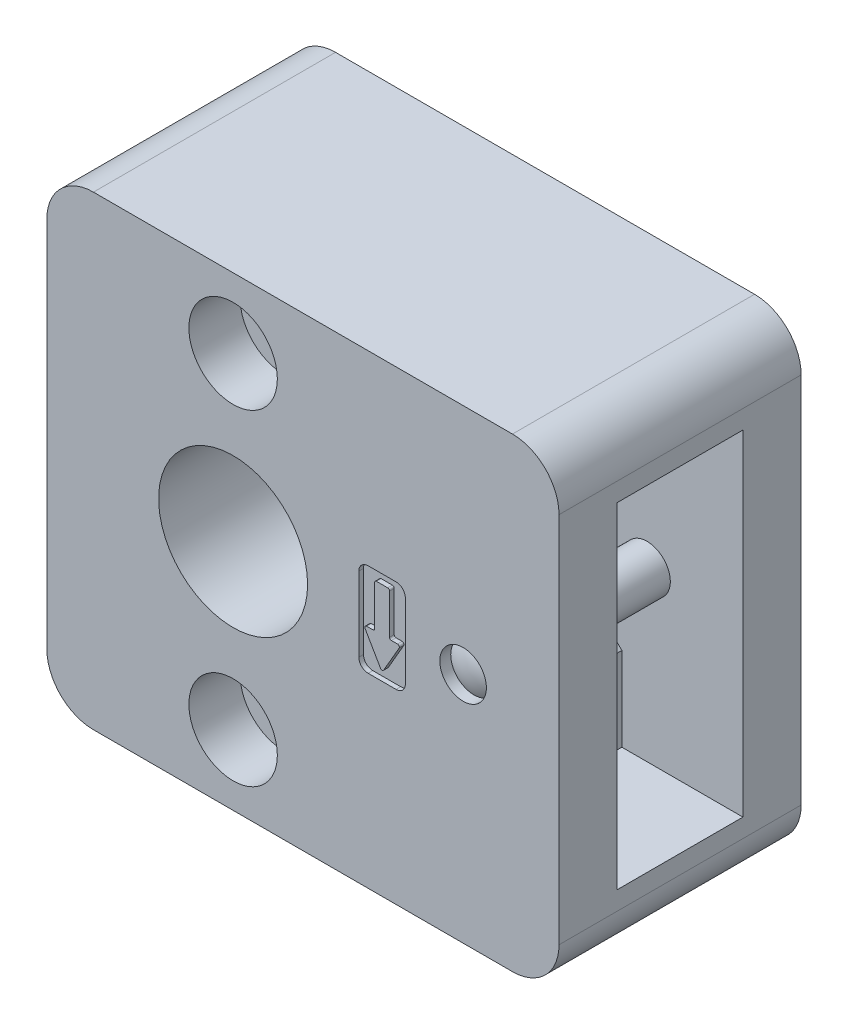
ISO-10303-21;
HEADER;
FILE_DESCRIPTION(('STEP AP214'),'2;1');
FILE_NAME('part.step','',(''),(''),'','','');
FILE_SCHEMA(('AUTOMOTIVE_DESIGN { 1 0 10303 214 1 1 1 1 }'));
ENDSEC;
DATA;
#1=APPLICATION_CONTEXT('core data for automotive mechanical design processes');
#2=APPLICATION_PROTOCOL_DEFINITION('international standard','automotive_design',2000,#1);
#3=PRODUCT_CONTEXT('',#1,'mechanical');
#4=PRODUCT('Part','Part','',(#3));
#5=PRODUCT_RELATED_PRODUCT_CATEGORY('part','',(#4));
#6=PRODUCT_DEFINITION_FORMATION('','',#4);
#7=PRODUCT_DEFINITION_CONTEXT('part definition',#1,'design');
#8=PRODUCT_DEFINITION('design','',#6,#7);
#9=PRODUCT_DEFINITION_SHAPE('','',#8);
#10=(LENGTH_UNIT() NAMED_UNIT(*) SI_UNIT(.MILLI.,.METRE.));
#11=(NAMED_UNIT(*) PLANE_ANGLE_UNIT() SI_UNIT($,.RADIAN.));
#12=(NAMED_UNIT(*) SI_UNIT($,.STERADIAN.) SOLID_ANGLE_UNIT());
#13=UNCERTAINTY_MEASURE_WITH_UNIT(LENGTH_MEASURE(1.E-05),#10,'distance_accuracy_value','');
#14=(GEOMETRIC_REPRESENTATION_CONTEXT(3) GLOBAL_UNCERTAINTY_ASSIGNED_CONTEXT((#13)) GLOBAL_UNIT_ASSIGNED_CONTEXT((#10,
#11,#12)) REPRESENTATION_CONTEXT('',''));
#15=CARTESIAN_POINT('',(0.,0.,0.));
#16=DIRECTION('',(0.,0.,1.));
#17=DIRECTION('',(1.,0.,0.));
#18=AXIS2_PLACEMENT_3D('',#15,#16,#17);
#19=CARTESIAN_POINT('',(24.7,0.,20.5));
#20=DIRECTION('',(0.,0.,1.));
#21=DIRECTION('',(0.649435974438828,-0.76041627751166,0.));
#22=AXIS2_PLACEMENT_3D('',#19,#20,#21);
#23=SPHERICAL_SURFACE('',#22,5.);
#24=CARTESIAN_POINT('',(24.7,0.,24.8301270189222));
#25=DIRECTION('',(0.,0.,-1.));
#26=DIRECTION('',(-0.649435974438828,0.76041627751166,0.));
#27=AXIS2_PLACEMENT_3D('',#24,#25,#26);
#28=CIRCLE('',#27,2.5);
#29=CARTESIAN_POINT('',(23.0764100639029,1.90104069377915,24.8301270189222));
#30=VERTEX_POINT('',#29);
#31=EDGE_CURVE('E931',#30,#30,#28,.F.);
#32=ORIENTED_EDGE('',*,*,#31,.T.);
#33=EDGE_LOOP('',(#32));
#34=FACE_BOUND('',#33,.T.);
#35=ADVANCED_FACE('F14',(#34),#23,.T.);
#36=CARTESIAN_POINT('',(24.7,0.,0.5));
#37=DIRECTION('',(0.,0.,1.));
#38=DIRECTION('',(0.649435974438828,-0.76041627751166,0.));
#39=AXIS2_PLACEMENT_3D('',#36,#37,#38);
#40=CYLINDRICAL_SURFACE('',#39,2.5);
#41=CARTESIAN_POINT('',(24.7,0.,19.75));
#42=DIRECTION('',(0.,0.,-1.));
#43=DIRECTION('',(-1.,0.,0.));
#44=AXIS2_PLACEMENT_3D('',#41,#42,#43);
#45=CIRCLE('',#44,2.5);
#46=CARTESIAN_POINT('',(22.2,0.,19.75));
#47=VERTEX_POINT('',#46);
#48=EDGE_CURVE('E22',#47,#47,#45,.T.);
#49=ORIENTED_EDGE('',*,*,#48,.T.);
#50=EDGE_LOOP('',(#49));
#51=FACE_BOUND('',#50,.T.);
#52=CARTESIAN_POINT('',(24.7,0.,6.25));
#53=DIRECTION('',(0.,0.,-1.));
#54=DIRECTION('',(-1.,0.,0.));
#55=AXIS2_PLACEMENT_3D('',#52,#53,#54);
#56=CIRCLE('',#55,2.5);
#57=CARTESIAN_POINT('',(22.2,0.,6.25));
#58=VERTEX_POINT('',#57);
#59=EDGE_CURVE('E9',#58,#58,#56,.T.);
#60=ORIENTED_EDGE('',*,*,#59,.F.);
#61=EDGE_LOOP('',(#60));
#62=FACE_BOUND('',#61,.T.);
#63=ADVANCED_FACE('F16',(#51,#62),#40,.T.);
#64=CARTESIAN_POINT('',(24.7,0.,0.5));
#65=DIRECTION('',(0.,0.,-1.));
#66=DIRECTION('',(-0.649435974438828,0.76041627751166,0.));
#67=AXIS2_PLACEMENT_3D('',#64,#65,#66);
#68=PLANE('',#67);
#69=CARTESIAN_POINT('',(24.7,0.,0.5));
#70=DIRECTION('',(0.,0.,-1.));
#71=DIRECTION('',(-0.649435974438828,0.76041627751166,0.));
#72=AXIS2_PLACEMENT_3D('',#69,#70,#71);
#73=CIRCLE('',#72,2.2856406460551);
#74=CARTESIAN_POINT('',(23.2156227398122,1.73803835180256,0.5));
#75=VERTEX_POINT('',#74);
#76=EDGE_CURVE('E932',#75,#75,#73,.T.);
#77=ORIENTED_EDGE('',*,*,#76,.T.);
#78=EDGE_LOOP('',(#77));
#79=FACE_BOUND('',#78,.T.);
#80=ADVANCED_FACE('F973',(#79),#68,.T.);
#81=CARTESIAN_POINT('',(24.7,0.,0.5));
#82=DIRECTION('',(0.,0.,1.));
#83=DIRECTION('',(0.649435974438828,-0.76041627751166,0.));
#84=AXIS2_PLACEMENT_3D('',#81,#82,#83);
#85=CONICAL_SURFACE('',#84,2.2856406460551,0.261799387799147);
#86=CARTESIAN_POINT('',(24.7,0.,1.3));
#87=DIRECTION('',(0.,0.,-1.));
#88=DIRECTION('',(-0.649435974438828,0.76041627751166,0.));
#89=AXIS2_PLACEMENT_3D('',#86,#87,#88);
#90=CIRCLE('',#89,2.5);
#91=CARTESIAN_POINT('',(23.0764100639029,1.90104069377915,1.3));
#92=VERTEX_POINT('',#91);
#93=EDGE_CURVE('E935',#92,#92,#90,.F.);
#94=ORIENTED_EDGE('',*,*,#93,.F.);
#95=EDGE_LOOP('',(#94));
#96=FACE_BOUND('',#95,.T.);
#97=ORIENTED_EDGE('',*,*,#76,.F.);
#98=EDGE_LOOP('',(#97));
#99=FACE_BOUND('',#98,.T.);
#100=ADVANCED_FACE('F975',(#96,#99),#85,.T.);
#101=CARTESIAN_POINT('',(-20.,25.,0.));
#102=DIRECTION('',(0.,0.,-1.));
#103=DIRECTION('',(-1.,0.,0.));
#104=AXIS2_PLACEMENT_3D('',#101,#102,#103);
#105=PLANE('',#104);
#106=CARTESIAN_POINT('',(16.,-3.76410161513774,0.));
#107=DIRECTION('',(0.,0.,1.));
#108=DIRECTION('',(-1.,0.,0.));
#109=AXIS2_PLACEMENT_3D('',#106,#107,#108);
#110=CIRCLE('',#109,0.2);
#111=CARTESIAN_POINT('',(15.8267949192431,-3.86410161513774,0.));
#112=VERTEX_POINT('',#111);
#113=CARTESIAN_POINT('',(16.1732050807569,-3.86410161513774,0.));
#114=VERTEX_POINT('',#113);
#115=EDGE_CURVE('E431',#112,#114,#110,.T.);
#116=ORIENTED_EDGE('',*,*,#115,.F.);
#117=DIRECTION('',(0.5,-0.866025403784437,0.));
#118=VECTOR('',#117,1.);
#119=CARTESIAN_POINT('',(14.1732050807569,-1.,0.));
#120=LINE('',#119,#118);
#121=CARTESIAN_POINT('',(14.1732050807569,-1.,0.));
#122=VERTEX_POINT('',#121);
#123=EDGE_CURVE('E429',#122,#112,#120,.T.);
#124=ORIENTED_EDGE('',*,*,#123,.F.);
#125=CARTESIAN_POINT('',(14.3464101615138,-0.9,0.));
#126=DIRECTION('',(0.,0.,1.));
#127=DIRECTION('',(-1.,0.,0.));
#128=AXIS2_PLACEMENT_3D('',#125,#126,#127);
#129=CIRCLE('',#128,0.2);
#130=CARTESIAN_POINT('',(14.3464101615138,-0.7,0.));
#131=VERTEX_POINT('',#130);
#132=EDGE_CURVE('E407',#131,#122,#129,.T.);
#133=ORIENTED_EDGE('',*,*,#132,.F.);
#134=DIRECTION('',(-1.,0.,0.));
#135=VECTOR('',#134,1.);
#136=CARTESIAN_POINT('',(15.,-0.7,0.));
#137=LINE('',#136,#135);
#138=CARTESIAN_POINT('',(15.,-0.7,0.));
#139=VERTEX_POINT('',#138);
#140=EDGE_CURVE('E417',#139,#131,#137,.T.);
#141=ORIENTED_EDGE('',*,*,#140,.F.);
#142=CARTESIAN_POINT('',(15.,-0.5,0.));
#143=DIRECTION('',(0.,0.,-1.));
#144=DIRECTION('',(-1.,0.,0.));
#145=AXIS2_PLACEMENT_3D('',#142,#143,#144);
#146=CIRCLE('',#145,0.2);
#147=CARTESIAN_POINT('',(15.2,-0.5,0.));
#148=VERTEX_POINT('',#147);
#149=EDGE_CURVE('E423',#148,#139,#146,.T.);
#150=ORIENTED_EDGE('',*,*,#149,.F.);
#151=DIRECTION('',(0.,-1.,0.));
#152=VECTOR('',#151,1.);
#153=CARTESIAN_POINT('',(15.2,3.8,0.));
#154=LINE('',#153,#152);
#155=CARTESIAN_POINT('',(15.2,3.8,0.));
#156=VERTEX_POINT('',#155);
#157=EDGE_CURVE('E436',#156,#148,#154,.T.);
#158=ORIENTED_EDGE('',*,*,#157,.F.);
#159=CARTESIAN_POINT('',(15.4,3.8,0.));
#160=DIRECTION('',(0.,0.,1.));
#161=DIRECTION('',(-1.,0.,0.));
#162=AXIS2_PLACEMENT_3D('',#159,#160,#161);
#163=CIRCLE('',#162,0.2);
#164=CARTESIAN_POINT('',(15.4,4.,0.));
#165=VERTEX_POINT('',#164);
#166=EDGE_CURVE('E439',#165,#156,#163,.T.);
#167=ORIENTED_EDGE('',*,*,#166,.F.);
#168=DIRECTION('',(-1.,0.,0.));
#169=VECTOR('',#168,1.);
#170=CARTESIAN_POINT('',(15.4,4.,0.));
#171=LINE('',#170,#169);
#172=CARTESIAN_POINT('',(16.6,4.,0.));
#173=VERTEX_POINT('',#172);
#174=EDGE_CURVE('E442',#173,#165,#171,.T.);
#175=ORIENTED_EDGE('',*,*,#174,.F.);
#176=CARTESIAN_POINT('',(16.6,3.8,0.));
#177=DIRECTION('',(0.,0.,1.));
#178=DIRECTION('',(1.,0.,0.));
#179=AXIS2_PLACEMENT_3D('',#176,#177,#178);
#180=CIRCLE('',#179,0.2);
#181=CARTESIAN_POINT('',(16.8,3.8,0.));
#182=VERTEX_POINT('',#181);
#183=EDGE_CURVE('E445',#182,#173,#180,.T.);
#184=ORIENTED_EDGE('',*,*,#183,.F.);
#185=DIRECTION('',(0.,1.,0.));
#186=VECTOR('',#185,1.);
#187=CARTESIAN_POINT('',(16.8,3.8,0.));
#188=LINE('',#187,#186);
#189=CARTESIAN_POINT('',(16.8,-0.5,0.));
#190=VERTEX_POINT('',#189);
#191=EDGE_CURVE('E448',#190,#182,#188,.T.);
#192=ORIENTED_EDGE('',*,*,#191,.F.);
#193=CARTESIAN_POINT('',(17.,-0.5,0.));
#194=DIRECTION('',(0.,0.,-1.));
#195=DIRECTION('',(1.,0.,0.));
#196=AXIS2_PLACEMENT_3D('',#193,#194,#195);
#197=CIRCLE('',#196,0.2);
#198=CARTESIAN_POINT('',(17.,-0.7,0.));
#199=VERTEX_POINT('',#198);
#200=EDGE_CURVE('E451',#199,#190,#197,.T.);
#201=ORIENTED_EDGE('',*,*,#200,.F.);
#202=DIRECTION('',(-1.,0.,0.));
#203=VECTOR('',#202,1.);
#204=CARTESIAN_POINT('',(17.,-0.7,0.));
#205=LINE('',#204,#203);
#206=CARTESIAN_POINT('',(17.6535898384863,-0.7,0.));
#207=VERTEX_POINT('',#206);
#208=EDGE_CURVE('E454',#207,#199,#205,.T.);
#209=ORIENTED_EDGE('',*,*,#208,.F.);
#210=CARTESIAN_POINT('',(17.6535898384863,-0.9,0.));
#211=DIRECTION('',(0.,0.,1.));
#212=DIRECTION('',(1.,0.,0.));
#213=AXIS2_PLACEMENT_3D('',#210,#211,#212);
#214=CIRCLE('',#213,0.2);
#215=CARTESIAN_POINT('',(17.8267949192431,-1.,0.));
#216=VERTEX_POINT('',#215);
#217=EDGE_CURVE('E457',#216,#207,#214,.T.);
#218=ORIENTED_EDGE('',*,*,#217,.F.);
#219=DIRECTION('',(0.5,0.866025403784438,0.));
#220=VECTOR('',#219,1.);
#221=CARTESIAN_POINT('',(17.8267949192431,-1.,0.));
#222=LINE('',#221,#220);
#223=EDGE_CURVE('E460',#114,#216,#222,.T.);
#224=ORIENTED_EDGE('',*,*,#223,.F.);
#225=EDGE_LOOP('',(#116,#124,#133,#141,#150,#158,#167,#175,#184,#192,#201,#209,#218,#224));
#226=FACE_BOUND('',#225,.T.);
#227=ADVANCED_FACE('F427',(#226),#105,.T.);
#228=CARTESIAN_POINT('',(-20.,25.,26.));
#229=DIRECTION('',(0.,0.,-1.));
#230=DIRECTION('',(-1.,0.,0.));
#231=AXIS2_PLACEMENT_3D('',#228,#229,#230);
#232=PLANE('',#231);
#233=CARTESIAN_POINT('',(16.,-3.76410161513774,26.));
#234=DIRECTION('',(0.,0.,1.));
#235=DIRECTION('',(-1.,0.,0.));
#236=AXIS2_PLACEMENT_3D('',#233,#234,#235);
#237=CIRCLE('',#236,0.2);
#238=CARTESIAN_POINT('',(15.8267949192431,-3.86410161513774,26.));
#239=VERTEX_POINT('',#238);
#240=CARTESIAN_POINT('',(16.1732050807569,-3.86410161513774,26.));
#241=VERTEX_POINT('',#240);
#242=EDGE_CURVE('E559',#239,#241,#237,.T.);
#243=ORIENTED_EDGE('',*,*,#242,.T.);
#244=DIRECTION('',(0.5,0.866025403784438,0.));
#245=VECTOR('',#244,1.);
#246=CARTESIAN_POINT('',(17.8267949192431,-1.,26.));
#247=LINE('',#246,#245);
#248=CARTESIAN_POINT('',(17.8267949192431,-1.,26.));
#249=VERTEX_POINT('',#248);
#250=EDGE_CURVE('E576',#241,#249,#247,.T.);
#251=ORIENTED_EDGE('',*,*,#250,.T.);
#252=CARTESIAN_POINT('',(17.6535898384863,-0.9,26.));
#253=DIRECTION('',(0.,0.,1.));
#254=DIRECTION('',(1.,0.,0.));
#255=AXIS2_PLACEMENT_3D('',#252,#253,#254);
#256=CIRCLE('',#255,0.2);
#257=CARTESIAN_POINT('',(17.6535898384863,-0.7,26.));
#258=VERTEX_POINT('',#257);
#259=EDGE_CURVE('E579',#249,#258,#256,.T.);
#260=ORIENTED_EDGE('',*,*,#259,.T.);
#261=DIRECTION('',(-1.,0.,0.));
#262=VECTOR('',#261,1.);
#263=CARTESIAN_POINT('',(17.,-0.7,26.));
#264=LINE('',#263,#262);
#265=CARTESIAN_POINT('',(17.,-0.7,26.));
#266=VERTEX_POINT('',#265);
#267=EDGE_CURVE('E582',#258,#266,#264,.T.);
#268=ORIENTED_EDGE('',*,*,#267,.T.);
#269=CARTESIAN_POINT('',(17.,-0.5,26.));
#270=DIRECTION('',(0.,0.,-1.));
#271=DIRECTION('',(1.,0.,0.));
#272=AXIS2_PLACEMENT_3D('',#269,#270,#271);
#273=CIRCLE('',#272,0.2);
#274=CARTESIAN_POINT('',(16.8,-0.5,26.));
#275=VERTEX_POINT('',#274);
#276=EDGE_CURVE('E585',#266,#275,#273,.T.);
#277=ORIENTED_EDGE('',*,*,#276,.T.);
#278=DIRECTION('',(0.,1.,0.));
#279=VECTOR('',#278,1.);
#280=CARTESIAN_POINT('',(16.8,3.8,26.));
#281=LINE('',#280,#279);
#282=CARTESIAN_POINT('',(16.8,3.8,26.));
#283=VERTEX_POINT('',#282);
#284=EDGE_CURVE('E588',#275,#283,#281,.T.);
#285=ORIENTED_EDGE('',*,*,#284,.T.);
#286=CARTESIAN_POINT('',(16.6,3.8,26.));
#287=DIRECTION('',(0.,0.,1.));
#288=DIRECTION('',(1.,0.,0.));
#289=AXIS2_PLACEMENT_3D('',#286,#287,#288);
#290=CIRCLE('',#289,0.2);
#291=CARTESIAN_POINT('',(16.6,4.,26.));
#292=VERTEX_POINT('',#291);
#293=EDGE_CURVE('E591',#283,#292,#290,.T.);
#294=ORIENTED_EDGE('',*,*,#293,.T.);
#295=DIRECTION('',(-1.,0.,0.));
#296=VECTOR('',#295,1.);
#297=CARTESIAN_POINT('',(15.4,4.,26.));
#298=LINE('',#297,#296);
#299=CARTESIAN_POINT('',(15.4,4.,26.));
#300=VERTEX_POINT('',#299);
#301=EDGE_CURVE('E594',#292,#300,#298,.T.);
#302=ORIENTED_EDGE('',*,*,#301,.T.);
#303=CARTESIAN_POINT('',(15.4,3.8,26.));
#304=DIRECTION('',(0.,0.,1.));
#305=DIRECTION('',(-1.,0.,0.));
#306=AXIS2_PLACEMENT_3D('',#303,#304,#305);
#307=CIRCLE('',#306,0.2);
#308=CARTESIAN_POINT('',(15.2,3.8,26.));
#309=VERTEX_POINT('',#308);
#310=EDGE_CURVE('E597',#300,#309,#307,.T.);
#311=ORIENTED_EDGE('',*,*,#310,.T.);
#312=DIRECTION('',(0.,-1.,0.));
#313=VECTOR('',#312,1.);
#314=CARTESIAN_POINT('',(15.2,3.8,26.));
#315=LINE('',#314,#313);
#316=CARTESIAN_POINT('',(15.2,-0.5,26.));
#317=VERTEX_POINT('',#316);
#318=EDGE_CURVE('E600',#309,#317,#315,.T.);
#319=ORIENTED_EDGE('',*,*,#318,.T.);
#320=CARTESIAN_POINT('',(15.,-0.5,26.));
#321=DIRECTION('',(0.,0.,-1.));
#322=DIRECTION('',(-1.,0.,0.));
#323=AXIS2_PLACEMENT_3D('',#320,#321,#322);
#324=CIRCLE('',#323,0.2);
#325=CARTESIAN_POINT('',(15.,-0.7,26.));
#326=VERTEX_POINT('',#325);
#327=EDGE_CURVE('E603',#317,#326,#324,.T.);
#328=ORIENTED_EDGE('',*,*,#327,.T.);
#329=DIRECTION('',(-1.,0.,0.));
#330=VECTOR('',#329,1.);
#331=CARTESIAN_POINT('',(15.,-0.7,26.));
#332=LINE('',#331,#330);
#333=CARTESIAN_POINT('',(14.3464101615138,-0.7,26.));
#334=VERTEX_POINT('',#333);
#335=EDGE_CURVE('E606',#326,#334,#332,.T.);
#336=ORIENTED_EDGE('',*,*,#335,.T.);
#337=CARTESIAN_POINT('',(14.3464101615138,-0.9,26.));
#338=DIRECTION('',(0.,0.,1.));
#339=DIRECTION('',(-1.,0.,0.));
#340=AXIS2_PLACEMENT_3D('',#337,#338,#339);
#341=CIRCLE('',#340,0.2);
#342=CARTESIAN_POINT('',(14.1732050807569,-1.,26.));
#343=VERTEX_POINT('',#342);
#344=EDGE_CURVE('E609',#334,#343,#341,.T.);
#345=ORIENTED_EDGE('',*,*,#344,.T.);
#346=DIRECTION('',(0.5,-0.866025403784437,0.));
#347=VECTOR('',#346,1.);
#348=CARTESIAN_POINT('',(14.1732050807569,-1.,26.));
#349=LINE('',#348,#347);
#350=EDGE_CURVE('E612',#343,#239,#349,.T.);
#351=ORIENTED_EDGE('',*,*,#350,.T.);
#352=EDGE_LOOP('',(#243,#251,#260,#268,#277,#285,#294,#302,#311,#319,#328,#336,#345,#351));
#353=FACE_BOUND('',#352,.T.);
#354=ADVANCED_FACE('F1001',(#353),#232,.F.);
#355=CARTESIAN_POINT('',(14.1732050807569,-1.,0.5));
#356=DIRECTION('',(0.866025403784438,0.5,0.));
#357=DIRECTION('',(-0.5,0.866025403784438,0.));
#358=AXIS2_PLACEMENT_3D('',#355,#356,#357);
#359=PLANE('',#358);
#360=ORIENTED_EDGE('',*,*,#123,.T.);
#361=DIRECTION('',(0.,0.,-1.));
#362=VECTOR('',#361,1.);
#363=CARTESIAN_POINT('',(15.8267949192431,-3.86410161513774,0.5));
#364=LINE('',#363,#362);
#365=CARTESIAN_POINT('',(15.8267949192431,-3.86410161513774,0.5));
#366=VERTEX_POINT('',#365);
#367=EDGE_CURVE('E490',#366,#112,#364,.T.);
#368=ORIENTED_EDGE('',*,*,#367,.F.);
#369=DIRECTION('',(0.5,-0.866025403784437,0.));
#370=VECTOR('',#369,1.);
#371=CARTESIAN_POINT('',(14.1732050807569,-1.,0.5));
#372=LINE('',#371,#370);
#373=CARTESIAN_POINT('',(14.1732050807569,-1.,0.5));
#374=VERTEX_POINT('',#373);
#375=EDGE_CURVE('E465',#374,#366,#372,.T.);
#376=ORIENTED_EDGE('',*,*,#375,.F.);
#377=DIRECTION('',(0.,0.,-1.));
#378=VECTOR('',#377,1.);
#379=CARTESIAN_POINT('',(14.1732050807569,-1.,0.5));
#380=LINE('',#379,#378);
#381=EDGE_CURVE('E414',#374,#122,#380,.T.);
#382=ORIENTED_EDGE('',*,*,#381,.T.);
#383=EDGE_LOOP('',(#360,#368,#376,#382));
#384=FACE_BOUND('',#383,.T.);
#385=ADVANCED_FACE('F1003',(#384),#359,.F.);
#386=CARTESIAN_POINT('',(14.3464101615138,-0.9,0.5));
#387=DIRECTION('',(0.,0.,-1.));
#388=DIRECTION('',(-1.,0.,0.));
#389=AXIS2_PLACEMENT_3D('',#386,#387,#388);
#390=CYLINDRICAL_SURFACE('',#389,0.2);
#391=ORIENTED_EDGE('',*,*,#132,.T.);
#392=ORIENTED_EDGE('',*,*,#381,.F.);
#393=CARTESIAN_POINT('',(14.3464101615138,-0.9,0.5));
#394=DIRECTION('',(0.,0.,1.));
#395=DIRECTION('',(-1.,0.,0.));
#396=AXIS2_PLACEMENT_3D('',#393,#394,#395);
#397=CIRCLE('',#396,0.2);
#398=CARTESIAN_POINT('',(14.3464101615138,-0.7,0.5));
#399=VERTEX_POINT('',#398);
#400=EDGE_CURVE('E410',#399,#374,#397,.T.);
#401=ORIENTED_EDGE('',*,*,#400,.F.);
#402=DIRECTION('',(0.,0.,-1.));
#403=VECTOR('',#402,1.);
#404=CARTESIAN_POINT('',(14.3464101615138,-0.7,0.5));
#405=LINE('',#404,#403);
#406=EDGE_CURVE('E403',#399,#131,#405,.T.);
#407=ORIENTED_EDGE('',*,*,#406,.T.);
#408=EDGE_LOOP('',(#391,#392,#401,#407));
#409=FACE_BOUND('',#408,.T.);
#410=ADVANCED_FACE('F405',(#409),#390,.T.);
#411=CARTESIAN_POINT('',(15.,-0.7,0.5));
#412=DIRECTION('',(0.,-1.,0.));
#413=DIRECTION('',(1.,0.,0.));
#414=AXIS2_PLACEMENT_3D('',#411,#412,#413);
#415=PLANE('',#414);
#416=ORIENTED_EDGE('',*,*,#140,.T.);
#417=ORIENTED_EDGE('',*,*,#406,.F.);
#418=DIRECTION('',(-1.,0.,0.));
#419=VECTOR('',#418,1.);
#420=CARTESIAN_POINT('',(15.,-0.7,0.5));
#421=LINE('',#420,#419);
#422=CARTESIAN_POINT('',(15.,-0.7,0.5));
#423=VERTEX_POINT('',#422);
#424=EDGE_CURVE('E468',#423,#399,#421,.T.);
#425=ORIENTED_EDGE('',*,*,#424,.F.);
#426=DIRECTION('',(0.,0.,-1.));
#427=VECTOR('',#426,1.);
#428=CARTESIAN_POINT('',(15.,-0.7,0.5));
#429=LINE('',#428,#427);
#430=EDGE_CURVE('E413',#423,#139,#429,.T.);
#431=ORIENTED_EDGE('',*,*,#430,.T.);
#432=EDGE_LOOP('',(#416,#417,#425,#431));
#433=FACE_BOUND('',#432,.T.);
#434=ADVANCED_FACE('F418',(#433),#415,.F.);
#435=CARTESIAN_POINT('',(15.,-0.5,0.5));
#436=DIRECTION('',(0.,0.,-1.));
#437=DIRECTION('',(-1.,0.,0.));
#438=AXIS2_PLACEMENT_3D('',#435,#436,#437);
#439=CYLINDRICAL_SURFACE('',#438,0.2);
#440=ORIENTED_EDGE('',*,*,#149,.T.);
#441=ORIENTED_EDGE('',*,*,#430,.F.);
#442=CARTESIAN_POINT('',(15.,-0.5,0.5));
#443=DIRECTION('',(0.,0.,-1.));
#444=DIRECTION('',(-1.,0.,0.));
#445=AXIS2_PLACEMENT_3D('',#442,#443,#444);
#446=CIRCLE('',#445,0.2);
#447=CARTESIAN_POINT('',(15.2,-0.5,0.5));
#448=VERTEX_POINT('',#447);
#449=EDGE_CURVE('E470',#448,#423,#446,.T.);
#450=ORIENTED_EDGE('',*,*,#449,.F.);
#451=DIRECTION('',(0.,0.,-1.));
#452=VECTOR('',#451,1.);
#453=CARTESIAN_POINT('',(15.2,-0.5,0.5));
#454=LINE('',#453,#452);
#455=EDGE_CURVE('E510',#448,#148,#454,.T.);
#456=ORIENTED_EDGE('',*,*,#455,.T.);
#457=EDGE_LOOP('',(#440,#441,#450,#456));
#458=FACE_BOUND('',#457,.T.);
#459=ADVANCED_FACE('F1800',(#458),#439,.F.);
#460=CARTESIAN_POINT('',(15.2,3.8,0.5));
#461=DIRECTION('',(1.,0.,0.));
#462=DIRECTION('',(0.,1.,0.));
#463=AXIS2_PLACEMENT_3D('',#460,#461,#462);
#464=PLANE('',#463);
#465=ORIENTED_EDGE('',*,*,#157,.T.);
#466=ORIENTED_EDGE('',*,*,#455,.F.);
#467=DIRECTION('',(0.,-1.,0.));
#468=VECTOR('',#467,1.);
#469=CARTESIAN_POINT('',(15.2,3.8,0.5));
#470=LINE('',#469,#468);
#471=CARTESIAN_POINT('',(15.2,3.8,0.5));
#472=VERTEX_POINT('',#471);
#473=EDGE_CURVE('E472',#472,#448,#470,.T.);
#474=ORIENTED_EDGE('',*,*,#473,.F.);
#475=DIRECTION('',(0.,0.,-1.));
#476=VECTOR('',#475,1.);
#477=CARTESIAN_POINT('',(15.2,3.8,0.5));
#478=LINE('',#477,#476);
#479=EDGE_CURVE('E508',#472,#156,#478,.T.);
#480=ORIENTED_EDGE('',*,*,#479,.T.);
#481=EDGE_LOOP('',(#465,#466,#474,#480));
#482=FACE_BOUND('',#481,.T.);
#483=ADVANCED_FACE('F1790',(#482),#464,.F.);
#484=CARTESIAN_POINT('',(15.4,3.8,0.5));
#485=DIRECTION('',(0.,0.,-1.));
#486=DIRECTION('',(-1.,0.,0.));
#487=AXIS2_PLACEMENT_3D('',#484,#485,#486);
#488=CYLINDRICAL_SURFACE('',#487,0.2);
#489=ORIENTED_EDGE('',*,*,#166,.T.);
#490=ORIENTED_EDGE('',*,*,#479,.F.);
#491=CARTESIAN_POINT('',(15.4,3.8,0.5));
#492=DIRECTION('',(0.,0.,1.));
#493=DIRECTION('',(-1.,0.,0.));
#494=AXIS2_PLACEMENT_3D('',#491,#492,#493);
#495=CIRCLE('',#494,0.2);
#496=CARTESIAN_POINT('',(15.4,4.,0.5));
#497=VERTEX_POINT('',#496);
#498=EDGE_CURVE('E474',#497,#472,#495,.T.);
#499=ORIENTED_EDGE('',*,*,#498,.F.);
#500=DIRECTION('',(0.,0.,-1.));
#501=VECTOR('',#500,1.);
#502=CARTESIAN_POINT('',(15.4,4.,0.5));
#503=LINE('',#502,#501);
#504=EDGE_CURVE('E506',#497,#165,#503,.T.);
#505=ORIENTED_EDGE('',*,*,#504,.T.);
#506=EDGE_LOOP('',(#489,#490,#499,#505));
#507=FACE_BOUND('',#506,.T.);
#508=ADVANCED_FACE('F1780',(#507),#488,.T.);
#509=CARTESIAN_POINT('',(15.4,4.,0.5));
#510=DIRECTION('',(0.,-1.,0.));
#511=DIRECTION('',(0.,0.,-1.));
#512=AXIS2_PLACEMENT_3D('',#509,#510,#511);
#513=PLANE('',#512);
#514=ORIENTED_EDGE('',*,*,#174,.T.);
#515=ORIENTED_EDGE('',*,*,#504,.F.);
#516=DIRECTION('',(-1.,0.,0.));
#517=VECTOR('',#516,1.);
#518=CARTESIAN_POINT('',(15.4,4.,0.5));
#519=LINE('',#518,#517);
#520=CARTESIAN_POINT('',(16.6,4.,0.5));
#521=VERTEX_POINT('',#520);
#522=EDGE_CURVE('E476',#521,#497,#519,.T.);
#523=ORIENTED_EDGE('',*,*,#522,.F.);
#524=DIRECTION('',(0.,0.,-1.));
#525=VECTOR('',#524,1.);
#526=CARTESIAN_POINT('',(16.6,4.,0.5));
#527=LINE('',#526,#525);
#528=EDGE_CURVE('E504',#521,#173,#527,.T.);
#529=ORIENTED_EDGE('',*,*,#528,.T.);
#530=EDGE_LOOP('',(#514,#515,#523,#529));
#531=FACE_BOUND('',#530,.T.);
#532=ADVANCED_FACE('F1770',(#531),#513,.F.);
#533=CARTESIAN_POINT('',(16.6,3.8,0.5));
#534=DIRECTION('',(0.,0.,-1.));
#535=DIRECTION('',(-1.,0.,0.));
#536=AXIS2_PLACEMENT_3D('',#533,#534,#535);
#537=CYLINDRICAL_SURFACE('',#536,0.2);
#538=ORIENTED_EDGE('',*,*,#183,.T.);
#539=ORIENTED_EDGE('',*,*,#528,.F.);
#540=CARTESIAN_POINT('',(16.6,3.8,0.5));
#541=DIRECTION('',(0.,0.,1.));
#542=DIRECTION('',(1.,0.,0.));
#543=AXIS2_PLACEMENT_3D('',#540,#541,#542);
#544=CIRCLE('',#543,0.2);
#545=CARTESIAN_POINT('',(16.8,3.8,0.5));
#546=VERTEX_POINT('',#545);
#547=EDGE_CURVE('E478',#546,#521,#544,.T.);
#548=ORIENTED_EDGE('',*,*,#547,.F.);
#549=DIRECTION('',(0.,0.,-1.));
#550=VECTOR('',#549,1.);
#551=CARTESIAN_POINT('',(16.8,3.8,0.5));
#552=LINE('',#551,#550);
#553=EDGE_CURVE('E502',#546,#182,#552,.T.);
#554=ORIENTED_EDGE('',*,*,#553,.T.);
#555=EDGE_LOOP('',(#538,#539,#548,#554));
#556=FACE_BOUND('',#555,.T.);
#557=ADVANCED_FACE('F1760',(#556),#537,.T.);
#558=CARTESIAN_POINT('',(16.8,3.8,0.5));
#559=DIRECTION('',(-1.,0.,0.));
#560=DIRECTION('',(0.,0.,1.));
#561=AXIS2_PLACEMENT_3D('',#558,#559,#560);
#562=PLANE('',#561);
#563=ORIENTED_EDGE('',*,*,#191,.T.);
#564=ORIENTED_EDGE('',*,*,#553,.F.);
#565=DIRECTION('',(0.,1.,0.));
#566=VECTOR('',#565,1.);
#567=CARTESIAN_POINT('',(16.8,3.8,0.5));
#568=LINE('',#567,#566);
#569=CARTESIAN_POINT('',(16.8,-0.5,0.5));
#570=VERTEX_POINT('',#569);
#571=EDGE_CURVE('E480',#570,#546,#568,.T.);
#572=ORIENTED_EDGE('',*,*,#571,.F.);
#573=DIRECTION('',(0.,0.,-1.));
#574=VECTOR('',#573,1.);
#575=CARTESIAN_POINT('',(16.8,-0.5,0.5));
#576=LINE('',#575,#574);
#577=EDGE_CURVE('E500',#570,#190,#576,.T.);
#578=ORIENTED_EDGE('',*,*,#577,.T.);
#579=EDGE_LOOP('',(#563,#564,#572,#578));
#580=FACE_BOUND('',#579,.T.);
#581=ADVANCED_FACE('F1750',(#580),#562,.F.);
#582=CARTESIAN_POINT('',(17.,-0.5,0.5));
#583=DIRECTION('',(0.,0.,-1.));
#584=DIRECTION('',(-1.,0.,0.));
#585=AXIS2_PLACEMENT_3D('',#582,#583,#584);
#586=CYLINDRICAL_SURFACE('',#585,0.2);
#587=ORIENTED_EDGE('',*,*,#200,.T.);
#588=ORIENTED_EDGE('',*,*,#577,.F.);
#589=CARTESIAN_POINT('',(17.,-0.5,0.5));
#590=DIRECTION('',(0.,0.,-1.));
#591=DIRECTION('',(1.,0.,0.));
#592=AXIS2_PLACEMENT_3D('',#589,#590,#591);
#593=CIRCLE('',#592,0.2);
#594=CARTESIAN_POINT('',(17.,-0.7,0.5));
#595=VERTEX_POINT('',#594);
#596=EDGE_CURVE('E482',#595,#570,#593,.T.);
#597=ORIENTED_EDGE('',*,*,#596,.F.);
#598=DIRECTION('',(0.,0.,-1.));
#599=VECTOR('',#598,1.);
#600=CARTESIAN_POINT('',(17.,-0.7,0.5));
#601=LINE('',#600,#599);
#602=EDGE_CURVE('E498',#595,#199,#601,.T.);
#603=ORIENTED_EDGE('',*,*,#602,.T.);
#604=EDGE_LOOP('',(#587,#588,#597,#603));
#605=FACE_BOUND('',#604,.T.);
#606=ADVANCED_FACE('F1740',(#605),#586,.F.);
#607=CARTESIAN_POINT('',(17.,-0.7,0.5));
#608=DIRECTION('',(0.,-1.,0.));
#609=DIRECTION('',(0.,0.,-1.));
#610=AXIS2_PLACEMENT_3D('',#607,#608,#609);
#611=PLANE('',#610);
#612=ORIENTED_EDGE('',*,*,#208,.T.);
#613=ORIENTED_EDGE('',*,*,#602,.F.);
#614=DIRECTION('',(-1.,0.,0.));
#615=VECTOR('',#614,1.);
#616=CARTESIAN_POINT('',(17.,-0.7,0.5));
#617=LINE('',#616,#615);
#618=CARTESIAN_POINT('',(17.6535898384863,-0.7,0.5));
#619=VERTEX_POINT('',#618);
#620=EDGE_CURVE('E484',#619,#595,#617,.T.);
#621=ORIENTED_EDGE('',*,*,#620,.F.);
#622=DIRECTION('',(0.,0.,-1.));
#623=VECTOR('',#622,1.);
#624=CARTESIAN_POINT('',(17.6535898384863,-0.7,0.5));
#625=LINE('',#624,#623);
#626=EDGE_CURVE('E496',#619,#207,#625,.T.);
#627=ORIENTED_EDGE('',*,*,#626,.T.);
#628=EDGE_LOOP('',(#612,#613,#621,#627));
#629=FACE_BOUND('',#628,.T.);
#630=ADVANCED_FACE('F1730',(#629),#611,.F.);
#631=CARTESIAN_POINT('',(17.6535898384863,-0.9,0.5));
#632=DIRECTION('',(0.,0.,-1.));
#633=DIRECTION('',(-1.,0.,0.));
#634=AXIS2_PLACEMENT_3D('',#631,#632,#633);
#635=CYLINDRICAL_SURFACE('',#634,0.2);
#636=ORIENTED_EDGE('',*,*,#217,.T.);
#637=ORIENTED_EDGE('',*,*,#626,.F.);
#638=CARTESIAN_POINT('',(17.6535898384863,-0.9,0.5));
#639=DIRECTION('',(0.,0.,1.));
#640=DIRECTION('',(1.,0.,0.));
#641=AXIS2_PLACEMENT_3D('',#638,#639,#640);
#642=CIRCLE('',#641,0.2);
#643=CARTESIAN_POINT('',(17.8267949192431,-1.,0.5));
#644=VERTEX_POINT('',#643);
#645=EDGE_CURVE('E486',#644,#619,#642,.T.);
#646=ORIENTED_EDGE('',*,*,#645,.F.);
#647=DIRECTION('',(0.,0.,-1.));
#648=VECTOR('',#647,1.);
#649=CARTESIAN_POINT('',(17.8267949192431,-1.,0.5));
#650=LINE('',#649,#648);
#651=EDGE_CURVE('E494',#644,#216,#650,.T.);
#652=ORIENTED_EDGE('',*,*,#651,.T.);
#653=EDGE_LOOP('',(#636,#637,#646,#652));
#654=FACE_BOUND('',#653,.T.);
#655=ADVANCED_FACE('F1203',(#654),#635,.T.);
#656=CARTESIAN_POINT('',(17.8267949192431,-1.,0.5));
#657=DIRECTION('',(-0.866025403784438,0.5,0.));
#658=DIRECTION('',(-0.5,-0.866025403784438,0.));
#659=AXIS2_PLACEMENT_3D('',#656,#657,#658);
#660=PLANE('',#659);
#661=ORIENTED_EDGE('',*,*,#223,.T.);
#662=ORIENTED_EDGE('',*,*,#651,.F.);
#663=DIRECTION('',(0.5,0.866025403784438,0.));
#664=VECTOR('',#663,1.);
#665=CARTESIAN_POINT('',(17.8267949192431,-1.,0.5));
#666=LINE('',#665,#664);
#667=CARTESIAN_POINT('',(16.1732050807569,-3.86410161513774,0.5));
#668=VERTEX_POINT('',#667);
#669=EDGE_CURVE('E488',#668,#644,#666,.T.);
#670=ORIENTED_EDGE('',*,*,#669,.F.);
#671=DIRECTION('',(0.,0.,-1.));
#672=VECTOR('',#671,1.);
#673=CARTESIAN_POINT('',(16.1732050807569,-3.86410161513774,0.5));
#674=LINE('',#673,#672);
#675=EDGE_CURVE('E491',#668,#114,#674,.T.);
#676=ORIENTED_EDGE('',*,*,#675,.T.);
#677=EDGE_LOOP('',(#661,#662,#670,#676));
#678=FACE_BOUND('',#677,.T.);
#679=ADVANCED_FACE('F1196',(#678),#660,.F.);
#680=CARTESIAN_POINT('',(16.,-3.76410161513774,0.5));
#681=DIRECTION('',(0.,0.,-1.));
#682=DIRECTION('',(-1.,0.,0.));
#683=AXIS2_PLACEMENT_3D('',#680,#681,#682);
#684=CYLINDRICAL_SURFACE('',#683,0.2);
#685=ORIENTED_EDGE('',*,*,#115,.T.);
#686=ORIENTED_EDGE('',*,*,#675,.F.);
#687=CARTESIAN_POINT('',(16.,-3.76410161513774,0.5));
#688=DIRECTION('',(0.,0.,1.));
#689=DIRECTION('',(-1.,0.,0.));
#690=AXIS2_PLACEMENT_3D('',#687,#688,#689);
#691=CIRCLE('',#690,0.2);
#692=EDGE_CURVE('E463',#366,#668,#691,.T.);
#693=ORIENTED_EDGE('',*,*,#692,.F.);
#694=ORIENTED_EDGE('',*,*,#367,.T.);
#695=EDGE_LOOP('',(#685,#686,#693,#694));
#696=FACE_BOUND('',#695,.T.);
#697=ADVANCED_FACE('F1034',(#696),#684,.T.);
#698=CARTESIAN_POINT('',(0.,-17.5,26.));
#699=DIRECTION('',(0.,0.,1.));
#700=DIRECTION('',(1.,0.,0.));
#701=AXIS2_PLACEMENT_3D('',#698,#699,#700);
#702=CYLINDRICAL_SURFACE('',#701,2.75);
#703=CARTESIAN_POINT('',(0.,-17.5,20.5));
#704=DIRECTION('',(0.,0.,1.));
#705=DIRECTION('',(1.,0.,0.));
#706=AXIS2_PLACEMENT_3D('',#703,#704,#705);
#707=CIRCLE('',#706,2.75);
#708=CARTESIAN_POINT('',(2.75,-17.5,20.5));
#709=VERTEX_POINT('',#708);
#710=EDGE_CURVE('E795',#709,#709,#707,.T.);
#711=ORIENTED_EDGE('',*,*,#710,.T.);
#712=EDGE_LOOP('',(#711));
#713=FACE_BOUND('',#712,.T.);
#714=CARTESIAN_POINT('',(0.,-17.5,5.5));
#715=DIRECTION('',(0.,0.,-1.));
#716=DIRECTION('',(-1.,0.,0.));
#717=AXIS2_PLACEMENT_3D('',#714,#715,#716);
#718=CIRCLE('',#717,2.75);
#719=CARTESIAN_POINT('',(-2.75,-17.5,5.5));
#720=VERTEX_POINT('',#719);
#721=EDGE_CURVE('E785',#720,#720,#718,.F.);
#722=ORIENTED_EDGE('',*,*,#721,.F.);
#723=EDGE_LOOP('',(#722));
#724=FACE_BOUND('',#723,.T.);
#725=ADVANCED_FACE('F1021',(#713,#724),#702,.F.);
#726=CARTESIAN_POINT('',(0.,17.5,26.));
#727=DIRECTION('',(0.,0.,1.));
#728=DIRECTION('',(1.,0.,0.));
#729=AXIS2_PLACEMENT_3D('',#726,#727,#728);
#730=CYLINDRICAL_SURFACE('',#729,2.75);
#731=CARTESIAN_POINT('',(0.,17.5,20.5));
#732=DIRECTION('',(0.,0.,1.));
#733=DIRECTION('',(1.,0.,0.));
#734=AXIS2_PLACEMENT_3D('',#731,#732,#733);
#735=CIRCLE('',#734,2.75);
#736=CARTESIAN_POINT('',(2.75,17.5,20.5));
#737=VERTEX_POINT('',#736);
#738=EDGE_CURVE('E786',#737,#737,#735,.T.);
#739=ORIENTED_EDGE('',*,*,#738,.T.);
#740=EDGE_LOOP('',(#739));
#741=FACE_BOUND('',#740,.T.);
#742=CARTESIAN_POINT('',(0.,17.5,5.5));
#743=DIRECTION('',(0.,0.,-1.));
#744=DIRECTION('',(-1.,0.,0.));
#745=AXIS2_PLACEMENT_3D('',#742,#743,#744);
#746=CIRCLE('',#745,2.75);
#747=CARTESIAN_POINT('',(-2.75,17.5,5.5));
#748=VERTEX_POINT('',#747);
#749=EDGE_CURVE('E778',#748,#748,#746,.F.);
#750=ORIENTED_EDGE('',*,*,#749,.F.);
#751=EDGE_LOOP('',(#750));
#752=FACE_BOUND('',#751,.T.);
#753=ADVANCED_FACE('F1006',(#741,#752),#730,.F.);
#754=CARTESIAN_POINT('',(16.,-3.76410161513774,25.5));
#755=DIRECTION('',(0.,0.,1.));
#756=DIRECTION('',(1.,0.,0.));
#757=AXIS2_PLACEMENT_3D('',#754,#755,#756);
#758=CYLINDRICAL_SURFACE('',#757,0.2);
#759=ORIENTED_EDGE('',*,*,#242,.F.);
#760=DIRECTION('',(0.,0.,1.));
#761=VECTOR('',#760,1.);
#762=CARTESIAN_POINT('',(15.8267949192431,-3.86410161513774,25.5));
#763=LINE('',#762,#761);
#764=CARTESIAN_POINT('',(15.8267949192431,-3.86410161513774,25.5));
#765=VERTEX_POINT('',#764);
#766=EDGE_CURVE('E658',#765,#239,#763,.T.);
#767=ORIENTED_EDGE('',*,*,#766,.F.);
#768=CARTESIAN_POINT('',(16.,-3.76410161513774,25.5));
#769=DIRECTION('',(0.,0.,1.));
#770=DIRECTION('',(-1.,0.,0.));
#771=AXIS2_PLACEMENT_3D('',#768,#769,#770);
#772=CIRCLE('',#771,0.2);
#773=CARTESIAN_POINT('',(16.1732050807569,-3.86410161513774,25.5));
#774=VERTEX_POINT('',#773);
#775=EDGE_CURVE('E615',#765,#774,#772,.T.);
#776=ORIENTED_EDGE('',*,*,#775,.T.);
#777=DIRECTION('',(0.,0.,1.));
#778=VECTOR('',#777,1.);
#779=CARTESIAN_POINT('',(16.1732050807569,-3.86410161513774,25.5));
#780=LINE('',#779,#778);
#781=EDGE_CURVE('E657',#774,#241,#780,.T.);
#782=ORIENTED_EDGE('',*,*,#781,.T.);
#783=EDGE_LOOP('',(#759,#767,#776,#782));
#784=FACE_BOUND('',#783,.T.);
#785=ADVANCED_FACE('F1020',(#784),#758,.T.);
#786=CARTESIAN_POINT('',(17.8267949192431,-1.,25.5));
#787=DIRECTION('',(0.866025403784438,-0.5,0.));
#788=DIRECTION('',(0.5,0.866025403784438,0.));
#789=AXIS2_PLACEMENT_3D('',#786,#787,#788);
#790=PLANE('',#789);
#791=ORIENTED_EDGE('',*,*,#250,.F.);
#792=ORIENTED_EDGE('',*,*,#781,.F.);
#793=DIRECTION('',(0.5,0.866025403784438,0.));
#794=VECTOR('',#793,1.);
#795=CARTESIAN_POINT('',(17.8267949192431,-1.,25.5));
#796=LINE('',#795,#794);
#797=CARTESIAN_POINT('',(17.8267949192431,-1.,25.5));
#798=VERTEX_POINT('',#797);
#799=EDGE_CURVE('E618',#774,#798,#796,.T.);
#800=ORIENTED_EDGE('',*,*,#799,.T.);
#801=DIRECTION('',(0.,0.,1.));
#802=VECTOR('',#801,1.);
#803=CARTESIAN_POINT('',(17.8267949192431,-1.,25.5));
#804=LINE('',#803,#802);
#805=EDGE_CURVE('E683',#798,#249,#804,.T.);
#806=ORIENTED_EDGE('',*,*,#805,.T.);
#807=EDGE_LOOP('',(#791,#792,#800,#806));
#808=FACE_BOUND('',#807,.T.);
#809=ADVANCED_FACE('F1029',(#808),#790,.T.);
#810=CARTESIAN_POINT('',(17.6535898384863,-0.9,25.5));
#811=DIRECTION('',(0.,0.,1.));
#812=DIRECTION('',(1.,0.,0.));
#813=AXIS2_PLACEMENT_3D('',#810,#811,#812);
#814=CYLINDRICAL_SURFACE('',#813,0.2);
#815=ORIENTED_EDGE('',*,*,#259,.F.);
#816=ORIENTED_EDGE('',*,*,#805,.F.);
#817=CARTESIAN_POINT('',(17.6535898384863,-0.9,25.5));
#818=DIRECTION('',(0.,0.,1.));
#819=DIRECTION('',(1.,0.,0.));
#820=AXIS2_PLACEMENT_3D('',#817,#818,#819);
#821=CIRCLE('',#820,0.2);
#822=CARTESIAN_POINT('',(17.6535898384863,-0.7,25.5));
#823=VERTEX_POINT('',#822);
#824=EDGE_CURVE('E621',#798,#823,#821,.T.);
#825=ORIENTED_EDGE('',*,*,#824,.T.);
#826=DIRECTION('',(0.,0.,1.));
#827=VECTOR('',#826,1.);
#828=CARTESIAN_POINT('',(17.6535898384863,-0.7,25.5));
#829=LINE('',#828,#827);
#830=EDGE_CURVE('E681',#823,#258,#829,.T.);
#831=ORIENTED_EDGE('',*,*,#830,.T.);
#832=EDGE_LOOP('',(#815,#816,#825,#831));
#833=FACE_BOUND('',#832,.T.);
#834=ADVANCED_FACE('F1609',(#833),#814,.T.);
#835=CARTESIAN_POINT('',(17.,-0.7,25.5));
#836=DIRECTION('',(0.,1.,0.));
#837=DIRECTION('',(0.,0.,1.));
#838=AXIS2_PLACEMENT_3D('',#835,#836,#837);
#839=PLANE('',#838);
#840=ORIENTED_EDGE('',*,*,#267,.F.);
#841=ORIENTED_EDGE('',*,*,#830,.F.);
#842=DIRECTION('',(-1.,0.,0.));
#843=VECTOR('',#842,1.);
#844=CARTESIAN_POINT('',(17.,-0.7,25.5));
#845=LINE('',#844,#843);
#846=CARTESIAN_POINT('',(17.,-0.7,25.5));
#847=VERTEX_POINT('',#846);
#848=EDGE_CURVE('E624',#823,#847,#845,.T.);
#849=ORIENTED_EDGE('',*,*,#848,.T.);
#850=DIRECTION('',(0.,0.,1.));
#851=VECTOR('',#850,1.);
#852=CARTESIAN_POINT('',(17.,-0.7,25.5));
#853=LINE('',#852,#851);
#854=EDGE_CURVE('E679',#847,#266,#853,.T.);
#855=ORIENTED_EDGE('',*,*,#854,.T.);
#856=EDGE_LOOP('',(#840,#841,#849,#855));
#857=FACE_BOUND('',#856,.T.);
#858=ADVANCED_FACE('F1620',(#857),#839,.T.);
#859=CARTESIAN_POINT('',(17.,-0.5,25.5));
#860=DIRECTION('',(0.,0.,1.));
#861=DIRECTION('',(1.,0.,0.));
#862=AXIS2_PLACEMENT_3D('',#859,#860,#861);
#863=CYLINDRICAL_SURFACE('',#862,0.2);
#864=ORIENTED_EDGE('',*,*,#276,.F.);
#865=ORIENTED_EDGE('',*,*,#854,.F.);
#866=CARTESIAN_POINT('',(17.,-0.5,25.5));
#867=DIRECTION('',(0.,0.,-1.));
#868=DIRECTION('',(1.,0.,0.));
#869=AXIS2_PLACEMENT_3D('',#866,#867,#868);
#870=CIRCLE('',#869,0.2);
#871=CARTESIAN_POINT('',(16.8,-0.5,25.5));
#872=VERTEX_POINT('',#871);
#873=EDGE_CURVE('E627',#847,#872,#870,.T.);
#874=ORIENTED_EDGE('',*,*,#873,.T.);
#875=DIRECTION('',(0.,0.,1.));
#876=VECTOR('',#875,1.);
#877=CARTESIAN_POINT('',(16.8,-0.5,25.5));
#878=LINE('',#877,#876);
#879=EDGE_CURVE('E677',#872,#275,#878,.T.);
#880=ORIENTED_EDGE('',*,*,#879,.T.);
#881=EDGE_LOOP('',(#864,#865,#874,#880));
#882=FACE_BOUND('',#881,.T.);
#883=ADVANCED_FACE('F1630',(#882),#863,.F.);
#884=CARTESIAN_POINT('',(16.8,3.8,25.5));
#885=DIRECTION('',(1.,0.,0.));
#886=DIRECTION('',(0.,0.,-1.));
#887=AXIS2_PLACEMENT_3D('',#884,#885,#886);
#888=PLANE('',#887);
#889=ORIENTED_EDGE('',*,*,#284,.F.);
#890=ORIENTED_EDGE('',*,*,#879,.F.);
#891=DIRECTION('',(0.,1.,0.));
#892=VECTOR('',#891,1.);
#893=CARTESIAN_POINT('',(16.8,3.8,25.5));
#894=LINE('',#893,#892);
#895=CARTESIAN_POINT('',(16.8,3.8,25.5));
#896=VERTEX_POINT('',#895);
#897=EDGE_CURVE('E630',#872,#896,#894,.T.);
#898=ORIENTED_EDGE('',*,*,#897,.T.);
#899=DIRECTION('',(0.,0.,1.));
#900=VECTOR('',#899,1.);
#901=CARTESIAN_POINT('',(16.8,3.8,25.5));
#902=LINE('',#901,#900);
#903=EDGE_CURVE('E675',#896,#283,#902,.T.);
#904=ORIENTED_EDGE('',*,*,#903,.T.);
#905=EDGE_LOOP('',(#889,#890,#898,#904));
#906=FACE_BOUND('',#905,.T.);
#907=ADVANCED_FACE('F1640',(#906),#888,.T.);
#908=CARTESIAN_POINT('',(16.6,3.8,25.5));
#909=DIRECTION('',(0.,0.,1.));
#910=DIRECTION('',(1.,0.,0.));
#911=AXIS2_PLACEMENT_3D('',#908,#909,#910);
#912=CYLINDRICAL_SURFACE('',#911,0.2);
#913=ORIENTED_EDGE('',*,*,#293,.F.);
#914=ORIENTED_EDGE('',*,*,#903,.F.);
#915=CARTESIAN_POINT('',(16.6,3.8,25.5));
#916=DIRECTION('',(0.,0.,1.));
#917=DIRECTION('',(1.,0.,0.));
#918=AXIS2_PLACEMENT_3D('',#915,#916,#917);
#919=CIRCLE('',#918,0.2);
#920=CARTESIAN_POINT('',(16.6,4.,25.5));
#921=VERTEX_POINT('',#920);
#922=EDGE_CURVE('E633',#896,#921,#919,.T.);
#923=ORIENTED_EDGE('',*,*,#922,.T.);
#924=DIRECTION('',(0.,0.,1.));
#925=VECTOR('',#924,1.);
#926=CARTESIAN_POINT('',(16.6,4.,25.5));
#927=LINE('',#926,#925);
#928=EDGE_CURVE('E673',#921,#292,#927,.T.);
#929=ORIENTED_EDGE('',*,*,#928,.T.);
#930=EDGE_LOOP('',(#913,#914,#923,#929));
#931=FACE_BOUND('',#930,.T.);
#932=ADVANCED_FACE('F1650',(#931),#912,.T.);
#933=CARTESIAN_POINT('',(15.4,4.,25.5));
#934=DIRECTION('',(0.,1.,0.));
#935=DIRECTION('',(0.,0.,1.));
#936=AXIS2_PLACEMENT_3D('',#933,#934,#935);
#937=PLANE('',#936);
#938=ORIENTED_EDGE('',*,*,#301,.F.);
#939=ORIENTED_EDGE('',*,*,#928,.F.);
#940=DIRECTION('',(-1.,0.,0.));
#941=VECTOR('',#940,1.);
#942=CARTESIAN_POINT('',(15.4,4.,25.5));
#943=LINE('',#942,#941);
#944=CARTESIAN_POINT('',(15.4,4.,25.5));
#945=VERTEX_POINT('',#944);
#946=EDGE_CURVE('E636',#921,#945,#943,.T.);
#947=ORIENTED_EDGE('',*,*,#946,.T.);
#948=DIRECTION('',(0.,0.,1.));
#949=VECTOR('',#948,1.);
#950=CARTESIAN_POINT('',(15.4,4.,25.5));
#951=LINE('',#950,#949);
#952=EDGE_CURVE('E671',#945,#300,#951,.T.);
#953=ORIENTED_EDGE('',*,*,#952,.T.);
#954=EDGE_LOOP('',(#938,#939,#947,#953));
#955=FACE_BOUND('',#954,.T.);
#956=ADVANCED_FACE('F1660',(#955),#937,.T.);
#957=CARTESIAN_POINT('',(15.4,3.8,25.5));
#958=DIRECTION('',(0.,0.,1.));
#959=DIRECTION('',(1.,0.,0.));
#960=AXIS2_PLACEMENT_3D('',#957,#958,#959);
#961=CYLINDRICAL_SURFACE('',#960,0.2);
#962=ORIENTED_EDGE('',*,*,#310,.F.);
#963=ORIENTED_EDGE('',*,*,#952,.F.);
#964=CARTESIAN_POINT('',(15.4,3.8,25.5));
#965=DIRECTION('',(0.,0.,1.));
#966=DIRECTION('',(-1.,0.,0.));
#967=AXIS2_PLACEMENT_3D('',#964,#965,#966);
#968=CIRCLE('',#967,0.2);
#969=CARTESIAN_POINT('',(15.2,3.8,25.5));
#970=VERTEX_POINT('',#969);
#971=EDGE_CURVE('E639',#945,#970,#968,.T.);
#972=ORIENTED_EDGE('',*,*,#971,.T.);
#973=DIRECTION('',(0.,0.,1.));
#974=VECTOR('',#973,1.);
#975=CARTESIAN_POINT('',(15.2,3.8,25.5));
#976=LINE('',#975,#974);
#977=EDGE_CURVE('E669',#970,#309,#976,.T.);
#978=ORIENTED_EDGE('',*,*,#977,.T.);
#979=EDGE_LOOP('',(#962,#963,#972,#978));
#980=FACE_BOUND('',#979,.T.);
#981=ADVANCED_FACE('F1670',(#980),#961,.T.);
#982=CARTESIAN_POINT('',(15.2,3.8,25.5));
#983=DIRECTION('',(-1.,0.,0.));
#984=DIRECTION('',(0.,-1.,0.));
#985=AXIS2_PLACEMENT_3D('',#982,#983,#984);
#986=PLANE('',#985);
#987=ORIENTED_EDGE('',*,*,#318,.F.);
#988=ORIENTED_EDGE('',*,*,#977,.F.);
#989=DIRECTION('',(0.,-1.,0.));
#990=VECTOR('',#989,1.);
#991=CARTESIAN_POINT('',(15.2,3.8,25.5));
#992=LINE('',#991,#990);
#993=CARTESIAN_POINT('',(15.2,-0.5,25.5));
#994=VERTEX_POINT('',#993);
#995=EDGE_CURVE('E642',#970,#994,#992,.T.);
#996=ORIENTED_EDGE('',*,*,#995,.T.);
#997=DIRECTION('',(0.,0.,1.));
#998=VECTOR('',#997,1.);
#999=CARTESIAN_POINT('',(15.2,-0.5,25.5));
#1000=LINE('',#999,#998);
#1001=EDGE_CURVE('E667',#994,#317,#1000,.T.);
#1002=ORIENTED_EDGE('',*,*,#1001,.T.);
#1003=EDGE_LOOP('',(#987,#988,#996,#1002));
#1004=FACE_BOUND('',#1003,.T.);
#1005=ADVANCED_FACE('F1680',(#1004),#986,.T.);
#1006=CARTESIAN_POINT('',(15.,-0.5,25.5));
#1007=DIRECTION('',(0.,0.,1.));
#1008=DIRECTION('',(1.,0.,0.));
#1009=AXIS2_PLACEMENT_3D('',#1006,#1007,#1008);
#1010=CYLINDRICAL_SURFACE('',#1009,0.2);
#1011=ORIENTED_EDGE('',*,*,#327,.F.);
#1012=ORIENTED_EDGE('',*,*,#1001,.F.);
#1013=CARTESIAN_POINT('',(15.,-0.5,25.5));
#1014=DIRECTION('',(0.,0.,-1.));
#1015=DIRECTION('',(-1.,0.,0.));
#1016=AXIS2_PLACEMENT_3D('',#1013,#1014,#1015);
#1017=CIRCLE('',#1016,0.2);
#1018=CARTESIAN_POINT('',(15.,-0.7,25.5));
#1019=VERTEX_POINT('',#1018);
#1020=EDGE_CURVE('E645',#994,#1019,#1017,.T.);
#1021=ORIENTED_EDGE('',*,*,#1020,.T.);
#1022=DIRECTION('',(0.,0.,1.));
#1023=VECTOR('',#1022,1.);
#1024=CARTESIAN_POINT('',(15.,-0.7,25.5));
#1025=LINE('',#1024,#1023);
#1026=EDGE_CURVE('E665',#1019,#326,#1025,.T.);
#1027=ORIENTED_EDGE('',*,*,#1026,.T.);
#1028=EDGE_LOOP('',(#1011,#1012,#1021,#1027));
#1029=FACE_BOUND('',#1028,.T.);
#1030=ADVANCED_FACE('F1690',(#1029),#1010,.F.);
#1031=CARTESIAN_POINT('',(15.,-0.7,25.5));
#1032=DIRECTION('',(0.,1.,0.));
#1033=DIRECTION('',(-1.,0.,0.));
#1034=AXIS2_PLACEMENT_3D('',#1031,#1032,#1033);
#1035=PLANE('',#1034);
#1036=ORIENTED_EDGE('',*,*,#335,.F.);
#1037=ORIENTED_EDGE('',*,*,#1026,.F.);
#1038=DIRECTION('',(-1.,0.,0.));
#1039=VECTOR('',#1038,1.);
#1040=CARTESIAN_POINT('',(15.,-0.7,25.5));
#1041=LINE('',#1040,#1039);
#1042=CARTESIAN_POINT('',(14.3464101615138,-0.7,25.5));
#1043=VERTEX_POINT('',#1042);
#1044=EDGE_CURVE('E648',#1019,#1043,#1041,.T.);
#1045=ORIENTED_EDGE('',*,*,#1044,.T.);
#1046=DIRECTION('',(0.,0.,1.));
#1047=VECTOR('',#1046,1.);
#1048=CARTESIAN_POINT('',(14.3464101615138,-0.7,25.5));
#1049=LINE('',#1048,#1047);
#1050=EDGE_CURVE('E663',#1043,#334,#1049,.T.);
#1051=ORIENTED_EDGE('',*,*,#1050,.T.);
#1052=EDGE_LOOP('',(#1036,#1037,#1045,#1051));
#1053=FACE_BOUND('',#1052,.T.);
#1054=ADVANCED_FACE('F1700',(#1053),#1035,.T.);
#1055=CARTESIAN_POINT('',(14.3464101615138,-0.9,25.5));
#1056=DIRECTION('',(0.,0.,1.));
#1057=DIRECTION('',(1.,0.,0.));
#1058=AXIS2_PLACEMENT_3D('',#1055,#1056,#1057);
#1059=CYLINDRICAL_SURFACE('',#1058,0.2);
#1060=ORIENTED_EDGE('',*,*,#344,.F.);
#1061=ORIENTED_EDGE('',*,*,#1050,.F.);
#1062=CARTESIAN_POINT('',(14.3464101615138,-0.9,25.5));
#1063=DIRECTION('',(0.,0.,1.));
#1064=DIRECTION('',(-1.,0.,0.));
#1065=AXIS2_PLACEMENT_3D('',#1062,#1063,#1064);
#1066=CIRCLE('',#1065,0.2);
#1067=CARTESIAN_POINT('',(14.1732050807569,-1.,25.5));
#1068=VERTEX_POINT('',#1067);
#1069=EDGE_CURVE('E651',#1043,#1068,#1066,.T.);
#1070=ORIENTED_EDGE('',*,*,#1069,.T.);
#1071=DIRECTION('',(0.,0.,1.));
#1072=VECTOR('',#1071,1.);
#1073=CARTESIAN_POINT('',(14.1732050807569,-1.,25.5));
#1074=LINE('',#1073,#1072);
#1075=EDGE_CURVE('E661',#1068,#343,#1074,.T.);
#1076=ORIENTED_EDGE('',*,*,#1075,.T.);
#1077=EDGE_LOOP('',(#1060,#1061,#1070,#1076));
#1078=FACE_BOUND('',#1077,.T.);
#1079=ADVANCED_FACE('F1710',(#1078),#1059,.T.);
#1080=CARTESIAN_POINT('',(14.1732050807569,-1.,25.5));
#1081=DIRECTION('',(-0.866025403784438,-0.5,0.));
#1082=DIRECTION('',(0.5,-0.866025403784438,0.));
#1083=AXIS2_PLACEMENT_3D('',#1080,#1081,#1082);
#1084=PLANE('',#1083);
#1085=ORIENTED_EDGE('',*,*,#350,.F.);
#1086=ORIENTED_EDGE('',*,*,#1075,.F.);
#1087=DIRECTION('',(0.5,-0.866025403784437,0.));
#1088=VECTOR('',#1087,1.);
#1089=CARTESIAN_POINT('',(14.1732050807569,-1.,25.5));
#1090=LINE('',#1089,#1088);
#1091=EDGE_CURVE('E654',#1068,#765,#1090,.T.);
#1092=ORIENTED_EDGE('',*,*,#1091,.T.);
#1093=ORIENTED_EDGE('',*,*,#766,.T.);
#1094=EDGE_LOOP('',(#1085,#1086,#1092,#1093));
#1095=FACE_BOUND('',#1094,.T.);
#1096=ADVANCED_FACE('F1032',(#1095),#1084,.T.);
#1097=CARTESIAN_POINT('',(17.5,4.,0.5));
#1098=DIRECTION('',(0.,0.,-1.));
#1099=DIRECTION('',(1.,0.,0.));
#1100=AXIS2_PLACEMENT_3D('',#1097,#1098,#1099);
#1101=PLANE('',#1100);
#1102=CARTESIAN_POINT('',(17.5,4.,0.5));
#1103=DIRECTION('',(0.,0.,1.));
#1104=DIRECTION('',(1.,0.,0.));
#1105=AXIS2_PLACEMENT_3D('',#1102,#1103,#1104);
#1106=CIRCLE('',#1105,1.);
#1107=CARTESIAN_POINT('',(18.5,4.,0.5));
#1108=VERTEX_POINT('',#1107);
#1109=CARTESIAN_POINT('',(17.5,5.,0.5));
#1110=VERTEX_POINT('',#1109);
#1111=EDGE_CURVE('E538',#1108,#1110,#1106,.T.);
#1112=ORIENTED_EDGE('',*,*,#1111,.F.);
#1113=DIRECTION('',(0.,1.,0.));
#1114=VECTOR('',#1113,1.);
#1115=CARTESIAN_POINT('',(18.5,4.,0.5));
#1116=LINE('',#1115,#1114);
#1117=CARTESIAN_POINT('',(18.5,-4.,0.5));
#1118=VERTEX_POINT('',#1117);
#1119=EDGE_CURVE('E541',#1118,#1108,#1116,.T.);
#1120=ORIENTED_EDGE('',*,*,#1119,.F.);
#1121=CARTESIAN_POINT('',(17.5,-4.,0.5));
#1122=DIRECTION('',(0.,0.,1.));
#1123=DIRECTION('',(1.,0.,0.));
#1124=AXIS2_PLACEMENT_3D('',#1121,#1122,#1123);
#1125=CIRCLE('',#1124,1.);
#1126=CARTESIAN_POINT('',(17.5,-5.,0.5));
#1127=VERTEX_POINT('',#1126);
#1128=EDGE_CURVE('E543',#1127,#1118,#1125,.T.);
#1129=ORIENTED_EDGE('',*,*,#1128,.F.);
#1130=DIRECTION('',(1.,0.,0.));
#1131=VECTOR('',#1130,1.);
#1132=CARTESIAN_POINT('',(14.5,-5.,0.5));
#1133=LINE('',#1132,#1131);
#1134=CARTESIAN_POINT('',(14.5,-5.,0.5));
#1135=VERTEX_POINT('',#1134);
#1136=EDGE_CURVE('E545',#1135,#1127,#1133,.T.);
#1137=ORIENTED_EDGE('',*,*,#1136,.F.);
#1138=CARTESIAN_POINT('',(14.5,-4.,0.5));
#1139=DIRECTION('',(0.,0.,1.));
#1140=DIRECTION('',(1.,0.,0.));
#1141=AXIS2_PLACEMENT_3D('',#1138,#1139,#1140);
#1142=CIRCLE('',#1141,1.);
#1143=CARTESIAN_POINT('',(13.5,-4.,0.5));
#1144=VERTEX_POINT('',#1143);
#1145=EDGE_CURVE('E547',#1144,#1135,#1142,.T.);
#1146=ORIENTED_EDGE('',*,*,#1145,.F.);
#1147=DIRECTION('',(0.,-1.,0.));
#1148=VECTOR('',#1147,1.);
#1149=CARTESIAN_POINT('',(13.5,4.,0.5));
#1150=LINE('',#1149,#1148);
#1151=CARTESIAN_POINT('',(13.5,4.,0.5));
#1152=VERTEX_POINT('',#1151);
#1153=EDGE_CURVE('E549',#1152,#1144,#1150,.T.);
#1154=ORIENTED_EDGE('',*,*,#1153,.F.);
#1155=CARTESIAN_POINT('',(14.5,4.,0.5));
#1156=DIRECTION('',(0.,0.,1.));
#1157=DIRECTION('',(-1.,0.,0.));
#1158=AXIS2_PLACEMENT_3D('',#1155,#1156,#1157);
#1159=CIRCLE('',#1158,1.);
#1160=CARTESIAN_POINT('',(14.5,5.,0.5));
#1161=VERTEX_POINT('',#1160);
#1162=EDGE_CURVE('E551',#1161,#1152,#1159,.T.);
#1163=ORIENTED_EDGE('',*,*,#1162,.F.);
#1164=DIRECTION('',(-1.,0.,0.));
#1165=VECTOR('',#1164,1.);
#1166=CARTESIAN_POINT('',(14.5,5.,0.5));
#1167=LINE('',#1166,#1165);
#1168=EDGE_CURVE('E553',#1110,#1161,#1167,.T.);
#1169=ORIENTED_EDGE('',*,*,#1168,.F.);
#1170=EDGE_LOOP('',(#1112,#1120,#1129,#1137,#1146,#1154,#1163,#1169));
#1171=FACE_BOUND('',#1170,.T.);
#1172=ORIENTED_EDGE('',*,*,#692,.T.);
#1173=ORIENTED_EDGE('',*,*,#669,.T.);
#1174=ORIENTED_EDGE('',*,*,#645,.T.);
#1175=ORIENTED_EDGE('',*,*,#620,.T.);
#1176=ORIENTED_EDGE('',*,*,#596,.T.);
#1177=ORIENTED_EDGE('',*,*,#571,.T.);
#1178=ORIENTED_EDGE('',*,*,#547,.T.);
#1179=ORIENTED_EDGE('',*,*,#522,.T.);
#1180=ORIENTED_EDGE('',*,*,#498,.T.);
#1181=ORIENTED_EDGE('',*,*,#473,.T.);
#1182=ORIENTED_EDGE('',*,*,#449,.T.);
#1183=ORIENTED_EDGE('',*,*,#424,.T.);
#1184=ORIENTED_EDGE('',*,*,#400,.T.);
#1185=ORIENTED_EDGE('',*,*,#375,.T.);
#1186=EDGE_LOOP('',(#1172,#1173,#1174,#1175,#1176,#1177,#1178,#1179,#1180,#1181,#1182,#1183,
#1184,#1185));
#1187=FACE_BOUND('',#1186,.T.);
#1188=ADVANCED_FACE('F1146',(#1171,#1187),#1101,.T.);
#1189=CARTESIAN_POINT('',(0.,-17.5,5.5));
#1190=DIRECTION('',(0.,0.,-1.));
#1191=DIRECTION('',(-1.,0.,0.));
#1192=AXIS2_PLACEMENT_3D('',#1189,#1190,#1191);
#1193=PLANE('',#1192);
#1194=CARTESIAN_POINT('',(0.,-17.5,5.5));
#1195=DIRECTION('',(0.,0.,-1.));
#1196=DIRECTION('',(-1.,0.,0.));
#1197=AXIS2_PLACEMENT_3D('',#1194,#1195,#1196);
#1198=CIRCLE('',#1197,4.75);
#1199=CARTESIAN_POINT('',(-4.75,-17.5,5.5));
#1200=VERTEX_POINT('',#1199);
#1201=EDGE_CURVE('E782',#1200,#1200,#1198,.T.);
#1202=ORIENTED_EDGE('',*,*,#1201,.T.);
#1203=EDGE_LOOP('',(#1202));
#1204=FACE_BOUND('',#1203,.T.);
#1205=ORIENTED_EDGE('',*,*,#721,.T.);
#1206=EDGE_LOOP('',(#1205));
#1207=FACE_BOUND('',#1206,.T.);
#1208=ADVANCED_FACE('F1212',(#1204,#1207),#1193,.T.);
#1209=CARTESIAN_POINT('',(0.,17.5,5.5));
#1210=DIRECTION('',(0.,0.,-1.));
#1211=DIRECTION('',(-1.,0.,0.));
#1212=AXIS2_PLACEMENT_3D('',#1209,#1210,#1211);
#1213=PLANE('',#1212);
#1214=CARTESIAN_POINT('',(0.,17.5,5.5));
#1215=DIRECTION('',(0.,0.,-1.));
#1216=DIRECTION('',(-1.,0.,0.));
#1217=AXIS2_PLACEMENT_3D('',#1214,#1215,#1216);
#1218=CIRCLE('',#1217,4.75);
#1219=CARTESIAN_POINT('',(-4.75,17.5,5.5));
#1220=VERTEX_POINT('',#1219);
#1221=EDGE_CURVE('E775',#1220,#1220,#1218,.T.);
#1222=ORIENTED_EDGE('',*,*,#1221,.T.);
#1223=EDGE_LOOP('',(#1222));
#1224=FACE_BOUND('',#1223,.T.);
#1225=ORIENTED_EDGE('',*,*,#749,.T.);
#1226=EDGE_LOOP('',(#1225));
#1227=FACE_BOUND('',#1226,.T.);
#1228=ADVANCED_FACE('F995',(#1224,#1227),#1213,.T.);
#1229=CARTESIAN_POINT('',(2.75,-17.5,20.5));
#1230=DIRECTION('',(0.,0.,-1.));
#1231=DIRECTION('',(-1.,0.,0.));
#1232=AXIS2_PLACEMENT_3D('',#1229,#1230,#1231);
#1233=PLANE('',#1232);
#1234=ORIENTED_EDGE('',*,*,#710,.F.);
#1235=EDGE_LOOP('',(#1234));
#1236=FACE_BOUND('',#1235,.T.);
#1237=CARTESIAN_POINT('',(0.,-17.5,20.5));
#1238=DIRECTION('',(0.,0.,1.));
#1239=DIRECTION('',(1.,0.,0.));
#1240=AXIS2_PLACEMENT_3D('',#1237,#1238,#1239);
#1241=CIRCLE('',#1240,4.75);
#1242=CARTESIAN_POINT('',(4.75,-17.5,20.5));
#1243=VERTEX_POINT('',#1242);
#1244=EDGE_CURVE('E798',#1243,#1243,#1241,.T.);
#1245=ORIENTED_EDGE('',*,*,#1244,.T.);
#1246=EDGE_LOOP('',(#1245));
#1247=FACE_BOUND('',#1246,.T.);
#1248=ADVANCED_FACE('F1044',(#1236,#1247),#1233,.F.);
#1249=CARTESIAN_POINT('',(2.75,17.5,20.5));
#1250=DIRECTION('',(0.,0.,-1.));
#1251=DIRECTION('',(-1.,0.,0.));
#1252=AXIS2_PLACEMENT_3D('',#1249,#1250,#1251);
#1253=PLANE('',#1252);
#1254=ORIENTED_EDGE('',*,*,#738,.F.);
#1255=EDGE_LOOP('',(#1254));
#1256=FACE_BOUND('',#1255,.T.);
#1257=CARTESIAN_POINT('',(0.,17.5,20.5));
#1258=DIRECTION('',(0.,0.,1.));
#1259=DIRECTION('',(1.,0.,0.));
#1260=AXIS2_PLACEMENT_3D('',#1257,#1258,#1259);
#1261=CIRCLE('',#1260,4.75);
#1262=CARTESIAN_POINT('',(4.75,17.5,20.5));
#1263=VERTEX_POINT('',#1262);
#1264=EDGE_CURVE('E789',#1263,#1263,#1261,.T.);
#1265=ORIENTED_EDGE('',*,*,#1264,.T.);
#1266=EDGE_LOOP('',(#1265));
#1267=FACE_BOUND('',#1266,.T.);
#1268=ADVANCED_FACE('F1041',(#1256,#1267),#1253,.F.);
#1269=CARTESIAN_POINT('',(17.5,4.,25.5));
#1270=DIRECTION('',(0.,0.,1.));
#1271=DIRECTION('',(1.,0.,0.));
#1272=AXIS2_PLACEMENT_3D('',#1269,#1270,#1271);
#1273=PLANE('',#1272);
#1274=ORIENTED_EDGE('',*,*,#1091,.F.);
#1275=ORIENTED_EDGE('',*,*,#1069,.F.);
#1276=ORIENTED_EDGE('',*,*,#1044,.F.);
#1277=ORIENTED_EDGE('',*,*,#1020,.F.);
#1278=ORIENTED_EDGE('',*,*,#995,.F.);
#1279=ORIENTED_EDGE('',*,*,#971,.F.);
#1280=ORIENTED_EDGE('',*,*,#946,.F.);
#1281=ORIENTED_EDGE('',*,*,#922,.F.);
#1282=ORIENTED_EDGE('',*,*,#897,.F.);
#1283=ORIENTED_EDGE('',*,*,#873,.F.);
#1284=ORIENTED_EDGE('',*,*,#848,.F.);
#1285=ORIENTED_EDGE('',*,*,#824,.F.);
#1286=ORIENTED_EDGE('',*,*,#799,.F.);
#1287=ORIENTED_EDGE('',*,*,#775,.F.);
#1288=EDGE_LOOP('',(#1274,#1275,#1276,#1277,#1278,#1279,#1280,#1281,#1282,#1283,#1284,#1285,
#1286,#1287));
#1289=FACE_BOUND('',#1288,.T.);
#1290=CARTESIAN_POINT('',(17.5,4.,25.5));
#1291=DIRECTION('',(0.,0.,1.));
#1292=DIRECTION('',(1.,0.,0.));
#1293=AXIS2_PLACEMENT_3D('',#1290,#1291,#1292);
#1294=CIRCLE('',#1293,1.);
#1295=CARTESIAN_POINT('',(18.5,4.,25.5));
#1296=VERTEX_POINT('',#1295);
#1297=CARTESIAN_POINT('',(17.5,5.,25.5));
#1298=VERTEX_POINT('',#1297);
#1299=EDGE_CURVE('E709',#1296,#1298,#1294,.T.);
#1300=ORIENTED_EDGE('',*,*,#1299,.T.);
#1301=DIRECTION('',(-1.,0.,0.));
#1302=VECTOR('',#1301,1.);
#1303=CARTESIAN_POINT('',(14.5,5.,25.5));
#1304=LINE('',#1303,#1302);
#1305=CARTESIAN_POINT('',(14.5,5.,25.5));
#1306=VERTEX_POINT('',#1305);
#1307=EDGE_CURVE('E712',#1298,#1306,#1304,.T.);
#1308=ORIENTED_EDGE('',*,*,#1307,.T.);
#1309=CARTESIAN_POINT('',(14.5,4.,25.5));
#1310=DIRECTION('',(0.,0.,1.));
#1311=DIRECTION('',(-1.,0.,0.));
#1312=AXIS2_PLACEMENT_3D('',#1309,#1310,#1311);
#1313=CIRCLE('',#1312,1.);
#1314=CARTESIAN_POINT('',(13.5,4.,25.5));
#1315=VERTEX_POINT('',#1314);
#1316=EDGE_CURVE('E715',#1306,#1315,#1313,.T.);
#1317=ORIENTED_EDGE('',*,*,#1316,.T.);
#1318=DIRECTION('',(0.,-1.,0.));
#1319=VECTOR('',#1318,1.);
#1320=CARTESIAN_POINT('',(13.5,4.,25.5));
#1321=LINE('',#1320,#1319);
#1322=CARTESIAN_POINT('',(13.5,-4.,25.5));
#1323=VERTEX_POINT('',#1322);
#1324=EDGE_CURVE('E718',#1315,#1323,#1321,.T.);
#1325=ORIENTED_EDGE('',*,*,#1324,.T.);
#1326=CARTESIAN_POINT('',(14.5,-4.,25.5));
#1327=DIRECTION('',(0.,0.,1.));
#1328=DIRECTION('',(1.,0.,0.));
#1329=AXIS2_PLACEMENT_3D('',#1326,#1327,#1328);
#1330=CIRCLE('',#1329,1.);
#1331=CARTESIAN_POINT('',(14.5,-5.,25.5));
#1332=VERTEX_POINT('',#1331);
#1333=EDGE_CURVE('E721',#1323,#1332,#1330,.T.);
#1334=ORIENTED_EDGE('',*,*,#1333,.T.);
#1335=DIRECTION('',(1.,0.,0.));
#1336=VECTOR('',#1335,1.);
#1337=CARTESIAN_POINT('',(14.5,-5.,25.5));
#1338=LINE('',#1337,#1336);
#1339=CARTESIAN_POINT('',(17.5,-5.,25.5));
#1340=VERTEX_POINT('',#1339);
#1341=EDGE_CURVE('E724',#1332,#1340,#1338,.T.);
#1342=ORIENTED_EDGE('',*,*,#1341,.T.);
#1343=CARTESIAN_POINT('',(17.5,-4.,25.5));
#1344=DIRECTION('',(0.,0.,1.));
#1345=DIRECTION('',(1.,0.,0.));
#1346=AXIS2_PLACEMENT_3D('',#1343,#1344,#1345);
#1347=CIRCLE('',#1346,1.);
#1348=CARTESIAN_POINT('',(18.5,-4.,25.5));
#1349=VERTEX_POINT('',#1348);
#1350=EDGE_CURVE('E727',#1340,#1349,#1347,.T.);
#1351=ORIENTED_EDGE('',*,*,#1350,.T.);
#1352=DIRECTION('',(0.,1.,0.));
#1353=VECTOR('',#1352,1.);
#1354=CARTESIAN_POINT('',(18.5,4.,25.5));
#1355=LINE('',#1354,#1353);
#1356=EDGE_CURVE('E730',#1349,#1296,#1355,.T.);
#1357=ORIENTED_EDGE('',*,*,#1356,.T.);
#1358=EDGE_LOOP('',(#1300,#1308,#1317,#1325,#1334,#1342,#1351,#1357));
#1359=FACE_BOUND('',#1358,.T.);
#1360=ADVANCED_FACE('F1033',(#1289,#1359),#1273,.T.);
#1361=CARTESIAN_POINT('',(17.5,-4.,0.5));
#1362=DIRECTION('',(0.,0.,-1.));
#1363=DIRECTION('',(-1.,0.,0.));
#1364=AXIS2_PLACEMENT_3D('',#1361,#1362,#1363);
#1365=CYLINDRICAL_SURFACE('',#1364,1.);
#1366=CARTESIAN_POINT('',(17.5,-4.,0.));
#1367=DIRECTION('',(0.,0.,1.));
#1368=DIRECTION('',(1.,0.,0.));
#1369=AXIS2_PLACEMENT_3D('',#1366,#1367,#1368);
#1370=CIRCLE('',#1369,1.);
#1371=CARTESIAN_POINT('',(17.5,-5.,0.));
#1372=VERTEX_POINT('',#1371);
#1373=CARTESIAN_POINT('',(18.5,-4.,0.));
#1374=VERTEX_POINT('',#1373);
#1375=EDGE_CURVE('E520',#1372,#1374,#1370,.T.);
#1376=ORIENTED_EDGE('',*,*,#1375,.F.);
#1377=DIRECTION('',(0.,0.,-1.));
#1378=VECTOR('',#1377,1.);
#1379=CARTESIAN_POINT('',(17.5,-5.,0.5));
#1380=LINE('',#1379,#1378);
#1381=EDGE_CURVE('E568',#1127,#1372,#1380,.T.);
#1382=ORIENTED_EDGE('',*,*,#1381,.F.);
#1383=ORIENTED_EDGE('',*,*,#1128,.T.);
#1384=DIRECTION('',(0.,0.,-1.));
#1385=VECTOR('',#1384,1.);
#1386=CARTESIAN_POINT('',(18.5,-4.,0.5));
#1387=LINE('',#1386,#1385);
#1388=EDGE_CURVE('E570',#1118,#1374,#1387,.T.);
#1389=ORIENTED_EDGE('',*,*,#1388,.T.);
#1390=EDGE_LOOP('',(#1376,#1382,#1383,#1389));
#1391=FACE_BOUND('',#1390,.T.);
#1392=ADVANCED_FACE('F1173',(#1391),#1365,.F.);
#1393=CARTESIAN_POINT('',(14.5,-5.,0.5));
#1394=DIRECTION('',(0.,1.,0.));
#1395=DIRECTION('',(0.,0.,1.));
#1396=AXIS2_PLACEMENT_3D('',#1393,#1394,#1395);
#1397=PLANE('',#1396);
#1398=DIRECTION('',(1.,0.,0.));
#1399=VECTOR('',#1398,1.);
#1400=CARTESIAN_POINT('',(14.5,-5.,0.));
#1401=LINE('',#1400,#1399);
#1402=CARTESIAN_POINT('',(14.5,-5.,0.));
#1403=VERTEX_POINT('',#1402);
#1404=EDGE_CURVE('E523',#1403,#1372,#1401,.T.);
#1405=ORIENTED_EDGE('',*,*,#1404,.F.);
#1406=DIRECTION('',(0.,0.,-1.));
#1407=VECTOR('',#1406,1.);
#1408=CARTESIAN_POINT('',(14.5,-5.,0.5));
#1409=LINE('',#1408,#1407);
#1410=EDGE_CURVE('E566',#1135,#1403,#1409,.T.);
#1411=ORIENTED_EDGE('',*,*,#1410,.F.);
#1412=ORIENTED_EDGE('',*,*,#1136,.T.);
#1413=ORIENTED_EDGE('',*,*,#1381,.T.);
#1414=EDGE_LOOP('',(#1405,#1411,#1412,#1413));
#1415=FACE_BOUND('',#1414,.T.);
#1416=ADVANCED_FACE('F1170',(#1415),#1397,.T.);
#1417=CARTESIAN_POINT('',(14.5,-4.,0.5));
#1418=DIRECTION('',(0.,0.,-1.));
#1419=DIRECTION('',(-1.,0.,0.));
#1420=AXIS2_PLACEMENT_3D('',#1417,#1418,#1419);
#1421=CYLINDRICAL_SURFACE('',#1420,1.);
#1422=CARTESIAN_POINT('',(14.5,-4.,0.));
#1423=DIRECTION('',(0.,0.,1.));
#1424=DIRECTION('',(1.,0.,0.));
#1425=AXIS2_PLACEMENT_3D('',#1422,#1423,#1424);
#1426=CIRCLE('',#1425,1.);
#1427=CARTESIAN_POINT('',(13.5,-4.,0.));
#1428=VERTEX_POINT('',#1427);
#1429=EDGE_CURVE('E526',#1428,#1403,#1426,.T.);
#1430=ORIENTED_EDGE('',*,*,#1429,.F.);
#1431=DIRECTION('',(0.,0.,-1.));
#1432=VECTOR('',#1431,1.);
#1433=CARTESIAN_POINT('',(13.5,-4.,0.5));
#1434=LINE('',#1433,#1432);
#1435=EDGE_CURVE('E564',#1144,#1428,#1434,.T.);
#1436=ORIENTED_EDGE('',*,*,#1435,.F.);
#1437=ORIENTED_EDGE('',*,*,#1145,.T.);
#1438=ORIENTED_EDGE('',*,*,#1410,.T.);
#1439=EDGE_LOOP('',(#1430,#1436,#1437,#1438));
#1440=FACE_BOUND('',#1439,.T.);
#1441=ADVANCED_FACE('F1165',(#1440),#1421,.F.);
#1442=CARTESIAN_POINT('',(13.5,4.,0.5));
#1443=DIRECTION('',(1.,0.,0.));
#1444=DIRECTION('',(0.,0.,-1.));
#1445=AXIS2_PLACEMENT_3D('',#1442,#1443,#1444);
#1446=PLANE('',#1445);
#1447=DIRECTION('',(0.,-1.,0.));
#1448=VECTOR('',#1447,1.);
#1449=CARTESIAN_POINT('',(13.5,4.,0.));
#1450=LINE('',#1449,#1448);
#1451=CARTESIAN_POINT('',(13.5,4.,0.));
#1452=VERTEX_POINT('',#1451);
#1453=EDGE_CURVE('E529',#1452,#1428,#1450,.T.);
#1454=ORIENTED_EDGE('',*,*,#1453,.F.);
#1455=DIRECTION('',(0.,0.,-1.));
#1456=VECTOR('',#1455,1.);
#1457=CARTESIAN_POINT('',(13.5,4.,0.5));
#1458=LINE('',#1457,#1456);
#1459=EDGE_CURVE('E562',#1152,#1452,#1458,.T.);
#1460=ORIENTED_EDGE('',*,*,#1459,.F.);
#1461=ORIENTED_EDGE('',*,*,#1153,.T.);
#1462=ORIENTED_EDGE('',*,*,#1435,.T.);
#1463=EDGE_LOOP('',(#1454,#1460,#1461,#1462));
#1464=FACE_BOUND('',#1463,.T.);
#1465=ADVANCED_FACE('F1161',(#1464),#1446,.T.);
#1466=CARTESIAN_POINT('',(14.5,4.,0.5));
#1467=DIRECTION('',(0.,0.,-1.));
#1468=DIRECTION('',(-1.,0.,0.));
#1469=AXIS2_PLACEMENT_3D('',#1466,#1467,#1468);
#1470=CYLINDRICAL_SURFACE('',#1469,1.);
#1471=CARTESIAN_POINT('',(14.5,4.,0.));
#1472=DIRECTION('',(0.,0.,1.));
#1473=DIRECTION('',(-1.,0.,0.));
#1474=AXIS2_PLACEMENT_3D('',#1471,#1472,#1473);
#1475=CIRCLE('',#1474,1.);
#1476=CARTESIAN_POINT('',(14.5,5.,0.));
#1477=VERTEX_POINT('',#1476);
#1478=EDGE_CURVE('E532',#1477,#1452,#1475,.T.);
#1479=ORIENTED_EDGE('',*,*,#1478,.F.);
#1480=DIRECTION('',(0.,0.,-1.));
#1481=VECTOR('',#1480,1.);
#1482=CARTESIAN_POINT('',(14.5,5.,0.5));
#1483=LINE('',#1482,#1481);
#1484=EDGE_CURVE('E560',#1161,#1477,#1483,.T.);
#1485=ORIENTED_EDGE('',*,*,#1484,.F.);
#1486=ORIENTED_EDGE('',*,*,#1162,.T.);
#1487=ORIENTED_EDGE('',*,*,#1459,.T.);
#1488=EDGE_LOOP('',(#1479,#1485,#1486,#1487));
#1489=FACE_BOUND('',#1488,.T.);
#1490=ADVANCED_FACE('F1156',(#1489),#1470,.F.);
#1491=CARTESIAN_POINT('',(14.5,5.,0.5));
#1492=DIRECTION('',(0.,-1.,0.));
#1493=DIRECTION('',(0.,0.,-1.));
#1494=AXIS2_PLACEMENT_3D('',#1491,#1492,#1493);
#1495=PLANE('',#1494);
#1496=DIRECTION('',(-1.,0.,0.));
#1497=VECTOR('',#1496,1.);
#1498=CARTESIAN_POINT('',(14.5,5.,0.));
#1499=LINE('',#1498,#1497);
#1500=CARTESIAN_POINT('',(17.5,5.,0.));
#1501=VERTEX_POINT('',#1500);
#1502=EDGE_CURVE('E535',#1501,#1477,#1499,.T.);
#1503=ORIENTED_EDGE('',*,*,#1502,.F.);
#1504=DIRECTION('',(0.,0.,-1.));
#1505=VECTOR('',#1504,1.);
#1506=CARTESIAN_POINT('',(17.5,5.,0.5));
#1507=LINE('',#1506,#1505);
#1508=EDGE_CURVE('E556',#1110,#1501,#1507,.T.);
#1509=ORIENTED_EDGE('',*,*,#1508,.F.);
#1510=ORIENTED_EDGE('',*,*,#1168,.T.);
#1511=ORIENTED_EDGE('',*,*,#1484,.T.);
#1512=EDGE_LOOP('',(#1503,#1509,#1510,#1511));
#1513=FACE_BOUND('',#1512,.T.);
#1514=ADVANCED_FACE('F1153',(#1513),#1495,.T.);
#1515=CARTESIAN_POINT('',(17.5,4.,0.5));
#1516=DIRECTION('',(0.,0.,-1.));
#1517=DIRECTION('',(-1.,0.,0.));
#1518=AXIS2_PLACEMENT_3D('',#1515,#1516,#1517);
#1519=CYLINDRICAL_SURFACE('',#1518,1.);
#1520=CARTESIAN_POINT('',(17.5,4.,0.));
#1521=DIRECTION('',(0.,0.,1.));
#1522=DIRECTION('',(1.,0.,0.));
#1523=AXIS2_PLACEMENT_3D('',#1520,#1521,#1522);
#1524=CIRCLE('',#1523,1.);
#1525=CARTESIAN_POINT('',(18.5,4.,0.));
#1526=VERTEX_POINT('',#1525);
#1527=EDGE_CURVE('E493',#1526,#1501,#1524,.T.);
#1528=ORIENTED_EDGE('',*,*,#1527,.F.);
#1529=DIRECTION('',(0.,0.,-1.));
#1530=VECTOR('',#1529,1.);
#1531=CARTESIAN_POINT('',(18.5,4.,0.5));
#1532=LINE('',#1531,#1530);
#1533=EDGE_CURVE('E555',#1108,#1526,#1532,.T.);
#1534=ORIENTED_EDGE('',*,*,#1533,.F.);
#1535=ORIENTED_EDGE('',*,*,#1111,.T.);
#1536=ORIENTED_EDGE('',*,*,#1508,.T.);
#1537=EDGE_LOOP('',(#1528,#1534,#1535,#1536));
#1538=FACE_BOUND('',#1537,.T.);
#1539=ADVANCED_FACE('F1143',(#1538),#1519,.F.);
#1540=CARTESIAN_POINT('',(18.5,4.,0.5));
#1541=DIRECTION('',(-1.,0.,0.));
#1542=DIRECTION('',(0.,0.,1.));
#1543=AXIS2_PLACEMENT_3D('',#1540,#1541,#1542);
#1544=PLANE('',#1543);
#1545=DIRECTION('',(0.,1.,0.));
#1546=VECTOR('',#1545,1.);
#1547=CARTESIAN_POINT('',(18.5,4.,0.));
#1548=LINE('',#1547,#1546);
#1549=EDGE_CURVE('E517',#1374,#1526,#1548,.T.);
#1550=ORIENTED_EDGE('',*,*,#1549,.F.);
#1551=ORIENTED_EDGE('',*,*,#1388,.F.);
#1552=ORIENTED_EDGE('',*,*,#1119,.T.);
#1553=ORIENTED_EDGE('',*,*,#1533,.T.);
#1554=EDGE_LOOP('',(#1550,#1551,#1552,#1553));
#1555=FACE_BOUND('',#1554,.T.);
#1556=ADVANCED_FACE('F1138',(#1555),#1544,.T.);
#1557=CARTESIAN_POINT('',(0.,0.,26.));
#1558=DIRECTION('',(0.,0.,-1.));
#1559=DIRECTION('',(-1.,0.,0.));
#1560=AXIS2_PLACEMENT_3D('',#1557,#1558,#1559);
#1561=CYLINDRICAL_SURFACE('',#1560,8.);
#1562=CARTESIAN_POINT('',(0.,0.,26.));
#1563=DIRECTION('',(0.,0.,1.));
#1564=DIRECTION('',(1.,0.,0.));
#1565=AXIS2_PLACEMENT_3D('',#1562,#1563,#1564);
#1566=CIRCLE('',#1565,8.);
#1567=CARTESIAN_POINT('',(8.,0.,26.));
#1568=VERTEX_POINT('',#1567);
#1569=EDGE_CURVE('E848',#1568,#1568,#1566,.T.);
#1570=ORIENTED_EDGE('',*,*,#1569,.T.);
#1571=EDGE_LOOP('',(#1570));
#1572=FACE_BOUND('',#1571,.T.);
#1573=CARTESIAN_POINT('',(0.,0.,0.));
#1574=DIRECTION('',(0.,0.,1.));
#1575=DIRECTION('',(1.,0.,0.));
#1576=AXIS2_PLACEMENT_3D('',#1573,#1574,#1575);
#1577=CIRCLE('',#1576,8.);
#1578=CARTESIAN_POINT('',(8.,0.,0.));
#1579=VERTEX_POINT('',#1578);
#1580=EDGE_CURVE('E845',#1579,#1579,#1577,.T.);
#1581=ORIENTED_EDGE('',*,*,#1580,.F.);
#1582=EDGE_LOOP('',(#1581));
#1583=FACE_BOUND('',#1582,.T.);
#1584=ADVANCED_FACE('F990',(#1572,#1583),#1561,.F.);
#1585=CARTESIAN_POINT('',(-15.,-20.,26.));
#1586=DIRECTION('',(0.,0.,-1.));
#1587=DIRECTION('',(-1.,0.,0.));
#1588=AXIS2_PLACEMENT_3D('',#1585,#1586,#1587);
#1589=CYLINDRICAL_SURFACE('',#1588,5.);
#1590=CARTESIAN_POINT('',(-15.,-20.,26.));
#1591=DIRECTION('',(0.,0.,-1.));
#1592=DIRECTION('',(-1.,0.,0.));
#1593=AXIS2_PLACEMENT_3D('',#1590,#1591,#1592);
#1594=CIRCLE('',#1593,5.);
#1595=CARTESIAN_POINT('',(-20.,-20.,26.));
#1596=VERTEX_POINT('',#1595);
#1597=CARTESIAN_POINT('',(-15.,-25.,26.));
#1598=VERTEX_POINT('',#1597);
#1599=EDGE_CURVE('E893',#1596,#1598,#1594,.F.);
#1600=ORIENTED_EDGE('',*,*,#1599,.F.);
#1601=DIRECTION('',(0.,0.,-1.));
#1602=VECTOR('',#1601,1.);
#1603=CARTESIAN_POINT('',(-20.,-20.,26.));
#1604=LINE('',#1603,#1602);
#1605=CARTESIAN_POINT('',(-20.,-20.,0.));
#1606=VERTEX_POINT('',#1605);
#1607=EDGE_CURVE('E906',#1606,#1596,#1604,.F.);
#1608=ORIENTED_EDGE('',*,*,#1607,.F.);
#1609=CARTESIAN_POINT('',(-15.,-20.,0.));
#1610=DIRECTION('',(0.,0.,-1.));
#1611=DIRECTION('',(-1.,0.,0.));
#1612=AXIS2_PLACEMENT_3D('',#1609,#1610,#1611);
#1613=CIRCLE('',#1612,5.);
#1614=CARTESIAN_POINT('',(-15.,-25.,0.));
#1615=VERTEX_POINT('',#1614);
#1616=EDGE_CURVE('E880',#1615,#1606,#1613,.T.);
#1617=ORIENTED_EDGE('',*,*,#1616,.F.);
#1618=DIRECTION('',(0.,0.,-1.));
#1619=VECTOR('',#1618,1.);
#1620=CARTESIAN_POINT('',(-15.,-25.,26.));
#1621=LINE('',#1620,#1619);
#1622=EDGE_CURVE('E888',#1598,#1615,#1621,.T.);
#1623=ORIENTED_EDGE('',*,*,#1622,.F.);
#1624=EDGE_LOOP('',(#1600,#1608,#1617,#1623));
#1625=FACE_BOUND('',#1624,.T.);
#1626=ADVANCED_FACE('F1192',(#1625),#1589,.T.);
#1627=CARTESIAN_POINT('',(-20.,-25.,26.));
#1628=DIRECTION('',(1.,0.,0.));
#1629=DIRECTION('',(0.,0.,-1.));
#1630=AXIS2_PLACEMENT_3D('',#1627,#1628,#1629);
#1631=PLANE('',#1630);
#1632=CARTESIAN_POINT('',(-20.,-10.,13.));
#1633=DIRECTION('',(-1.,0.,0.));
#1634=DIRECTION('',(0.,0.,1.));
#1635=AXIS2_PLACEMENT_3D('',#1632,#1633,#1634);
#1636=CIRCLE('',#1635,2.5);
#1637=CARTESIAN_POINT('',(-20.,-10.,15.5));
#1638=VERTEX_POINT('',#1637);
#1639=EDGE_CURVE('E1857',#1638,#1638,#1636,.T.);
#1640=ORIENTED_EDGE('',*,*,#1639,.F.);
#1641=EDGE_LOOP('',(#1640));
#1642=FACE_BOUND('',#1641,.T.);
#1643=CARTESIAN_POINT('',(-20.,10.,13.));
#1644=DIRECTION('',(-1.,0.,0.));
#1645=DIRECTION('',(0.,0.,1.));
#1646=AXIS2_PLACEMENT_3D('',#1643,#1644,#1645);
#1647=CIRCLE('',#1646,2.5);
#1648=CARTESIAN_POINT('',(-20.,10.,15.5));
#1649=VERTEX_POINT('',#1648);
#1650=EDGE_CURVE('E1851',#1649,#1649,#1647,.T.);
#1651=ORIENTED_EDGE('',*,*,#1650,.F.);
#1652=EDGE_LOOP('',(#1651));
#1653=FACE_BOUND('',#1652,.T.);
#1654=DIRECTION('',(0.,-1.,0.));
#1655=VECTOR('',#1654,1.);
#1656=CARTESIAN_POINT('',(-20.,-25.,26.));
#1657=LINE('',#1656,#1655);
#1658=CARTESIAN_POINT('',(-20.,20.,26.));
#1659=VERTEX_POINT('',#1658);
#1660=EDGE_CURVE('E863',#1659,#1596,#1657,.T.);
#1661=ORIENTED_EDGE('',*,*,#1660,.F.);
#1662=DIRECTION('',(0.,0.,-1.));
#1663=VECTOR('',#1662,1.);
#1664=CARTESIAN_POINT('',(-20.,20.,26.));
#1665=LINE('',#1664,#1663);
#1666=CARTESIAN_POINT('',(-20.,20.,0.));
#1667=VERTEX_POINT('',#1666);
#1668=EDGE_CURVE('E908',#1659,#1667,#1665,.T.);
#1669=ORIENTED_EDGE('',*,*,#1668,.T.);
#1670=DIRECTION('',(0.,-1.,0.));
#1671=VECTOR('',#1670,1.);
#1672=CARTESIAN_POINT('',(-20.,-25.,0.));
#1673=LINE('',#1672,#1671);
#1674=EDGE_CURVE('E851',#1667,#1606,#1673,.T.);
#1675=ORIENTED_EDGE('',*,*,#1674,.T.);
#1676=ORIENTED_EDGE('',*,*,#1607,.T.);
#1677=EDGE_LOOP('',(#1661,#1669,#1675,#1676));
#1678=FACE_BOUND('',#1677,.T.);
#1679=ADVANCED_FACE('F1063',(#1642,#1653,#1678),#1631,.F.);
#1680=CARTESIAN_POINT('',(-15.,20.,26.));
#1681=DIRECTION('',(0.,0.,-1.));
#1682=DIRECTION('',(-1.,0.,0.));
#1683=AXIS2_PLACEMENT_3D('',#1680,#1681,#1682);
#1684=CYLINDRICAL_SURFACE('',#1683,5.);
#1685=CARTESIAN_POINT('',(-15.,20.,26.));
#1686=DIRECTION('',(0.,0.,-1.));
#1687=DIRECTION('',(-1.,0.,0.));
#1688=AXIS2_PLACEMENT_3D('',#1685,#1686,#1687);
#1689=CIRCLE('',#1688,5.);
#1690=CARTESIAN_POINT('',(-15.,25.,26.));
#1691=VERTEX_POINT('',#1690);
#1692=EDGE_CURVE('E895',#1691,#1659,#1689,.F.);
#1693=ORIENTED_EDGE('',*,*,#1692,.F.);
#1694=DIRECTION('',(0.,0.,-1.));
#1695=VECTOR('',#1694,1.);
#1696=CARTESIAN_POINT('',(-15.,25.,26.));
#1697=LINE('',#1696,#1695);
#1698=CARTESIAN_POINT('',(-15.,25.,0.));
#1699=VERTEX_POINT('',#1698);
#1700=EDGE_CURVE('E901',#1699,#1691,#1697,.F.);
#1701=ORIENTED_EDGE('',*,*,#1700,.F.);
#1702=CARTESIAN_POINT('',(-15.,20.,0.));
#1703=DIRECTION('',(0.,0.,-1.));
#1704=DIRECTION('',(-1.,0.,0.));
#1705=AXIS2_PLACEMENT_3D('',#1702,#1703,#1704);
#1706=CIRCLE('',#1705,5.);
#1707=EDGE_CURVE('E882',#1667,#1699,#1706,.T.);
#1708=ORIENTED_EDGE('',*,*,#1707,.F.);
#1709=ORIENTED_EDGE('',*,*,#1668,.F.);
#1710=EDGE_LOOP('',(#1693,#1701,#1708,#1709));
#1711=FACE_BOUND('',#1710,.T.);
#1712=ADVANCED_FACE('F1078',(#1711),#1684,.T.);
#1713=CARTESIAN_POINT('',(-20.,25.,26.));
#1714=DIRECTION('',(0.,-1.,0.));
#1715=DIRECTION('',(0.,0.,-1.));
#1716=AXIS2_PLACEMENT_3D('',#1713,#1714,#1715);
#1717=PLANE('',#1716);
#1718=DIRECTION('',(-1.,0.,0.));
#1719=VECTOR('',#1718,1.);
#1720=CARTESIAN_POINT('',(-20.,25.,26.));
#1721=LINE('',#1720,#1719);
#1722=CARTESIAN_POINT('',(30.,25.,26.));
#1723=VERTEX_POINT('',#1722);
#1724=EDGE_CURVE('E872',#1723,#1691,#1721,.T.);
#1725=ORIENTED_EDGE('',*,*,#1724,.F.);
#1726=DIRECTION('',(0.,0.,-1.));
#1727=VECTOR('',#1726,1.);
#1728=CARTESIAN_POINT('',(30.,25.,26.));
#1729=LINE('',#1728,#1727);
#1730=CARTESIAN_POINT('',(30.,25.,0.));
#1731=VERTEX_POINT('',#1730);
#1732=EDGE_CURVE('E903',#1723,#1731,#1729,.T.);
#1733=ORIENTED_EDGE('',*,*,#1732,.T.);
#1734=DIRECTION('',(-1.,0.,0.));
#1735=VECTOR('',#1734,1.);
#1736=CARTESIAN_POINT('',(-20.,25.,0.));
#1737=LINE('',#1736,#1735);
#1738=EDGE_CURVE('E860',#1731,#1699,#1737,.T.);
#1739=ORIENTED_EDGE('',*,*,#1738,.T.);
#1740=ORIENTED_EDGE('',*,*,#1700,.T.);
#1741=EDGE_LOOP('',(#1725,#1733,#1739,#1740));
#1742=FACE_BOUND('',#1741,.T.);
#1743=ADVANCED_FACE('F1076',(#1742),#1717,.F.);
#1744=CARTESIAN_POINT('',(30.,20.,26.));
#1745=DIRECTION('',(0.,0.,-1.));
#1746=DIRECTION('',(-1.,0.,0.));
#1747=AXIS2_PLACEMENT_3D('',#1744,#1745,#1746);
#1748=CYLINDRICAL_SURFACE('',#1747,5.);
#1749=CARTESIAN_POINT('',(30.,20.,26.));
#1750=DIRECTION('',(0.,0.,-1.));
#1751=DIRECTION('',(-1.,0.,0.));
#1752=AXIS2_PLACEMENT_3D('',#1749,#1750,#1751);
#1753=CIRCLE('',#1752,5.);
#1754=CARTESIAN_POINT('',(35.,20.,26.));
#1755=VERTEX_POINT('',#1754);
#1756=EDGE_CURVE('E897',#1755,#1723,#1753,.F.);
#1757=ORIENTED_EDGE('',*,*,#1756,.F.);
#1758=DIRECTION('',(0.,0.,-1.));
#1759=VECTOR('',#1758,1.);
#1760=CARTESIAN_POINT('',(35.,20.,26.));
#1761=LINE('',#1760,#1759);
#1762=CARTESIAN_POINT('',(35.,20.,0.));
#1763=VERTEX_POINT('',#1762);
#1764=EDGE_CURVE('E875',#1763,#1755,#1761,.F.);
#1765=ORIENTED_EDGE('',*,*,#1764,.F.);
#1766=CARTESIAN_POINT('',(30.,20.,0.));
#1767=DIRECTION('',(0.,0.,-1.));
#1768=DIRECTION('',(-1.,0.,0.));
#1769=AXIS2_PLACEMENT_3D('',#1766,#1767,#1768);
#1770=CIRCLE('',#1769,5.);
#1771=EDGE_CURVE('E884',#1731,#1763,#1770,.T.);
#1772=ORIENTED_EDGE('',*,*,#1771,.F.);
#1773=ORIENTED_EDGE('',*,*,#1732,.F.);
#1774=EDGE_LOOP('',(#1757,#1765,#1772,#1773));
#1775=FACE_BOUND('',#1774,.T.);
#1776=ADVANCED_FACE('F1067',(#1775),#1748,.T.);
#1777=CARTESIAN_POINT('',(22.,-18.,6.25));
#1778=DIRECTION('',(0.,-1.,0.));
#1779=DIRECTION('',(0.,0.,-1.));
#1780=AXIS2_PLACEMENT_3D('',#1777,#1778,#1779);
#1781=PLANE('',#1780);
#1782=DIRECTION('',(1.,0.,0.));
#1783=VECTOR('',#1782,1.);
#1784=CARTESIAN_POINT('',(22.,-18.,19.75));
#1785=LINE('',#1784,#1783);
#1786=CARTESIAN_POINT('',(22.,-18.,19.75));
#1787=VERTEX_POINT('',#1786);
#1788=CARTESIAN_POINT('',(35.,-18.,19.75));
#1789=VERTEX_POINT('',#1788);
#1790=EDGE_CURVE('E808',#1787,#1789,#1785,.T.);
#1791=ORIENTED_EDGE('',*,*,#1790,.T.);
#1792=DIRECTION('',(0.,0.,1.));
#1793=VECTOR('',#1792,1.);
#1794=CARTESIAN_POINT('',(35.,-18.,6.25));
#1795=LINE('',#1794,#1793);
#1796=CARTESIAN_POINT('',(35.,-18.,6.25));
#1797=VERTEX_POINT('',#1796);
#1798=EDGE_CURVE('E835',#1797,#1789,#1795,.T.);
#1799=ORIENTED_EDGE('',*,*,#1798,.F.);
#1800=DIRECTION('',(1.,0.,0.));
#1801=VECTOR('',#1800,1.);
#1802=CARTESIAN_POINT('',(22.,-18.,6.25));
#1803=LINE('',#1802,#1801);
#1804=CARTESIAN_POINT('',(22.,-18.,6.25));
#1805=VERTEX_POINT('',#1804);
#1806=EDGE_CURVE('E820',#1805,#1797,#1803,.T.);
#1807=ORIENTED_EDGE('',*,*,#1806,.F.);
#1808=DIRECTION('',(0.,0.,1.));
#1809=VECTOR('',#1808,1.);
#1810=CARTESIAN_POINT('',(22.,-18.,6.25));
#1811=LINE('',#1810,#1809);
#1812=EDGE_CURVE('E828',#1805,#1787,#1811,.T.);
#1813=ORIENTED_EDGE('',*,*,#1812,.T.);
#1814=EDGE_LOOP('',(#1791,#1799,#1807,#1813));
#1815=FACE_BOUND('',#1814,.T.);
#1816=ADVANCED_FACE('F1017',(#1815),#1781,.F.);
#1817=CARTESIAN_POINT('',(35.,-25.,26.));
#1818=DIRECTION('',(-1.,0.,0.));
#1819=DIRECTION('',(0.,0.,1.));
#1820=AXIS2_PLACEMENT_3D('',#1817,#1818,#1819);
#1821=PLANE('',#1820);
#1822=DIRECTION('',(0.,0.,1.));
#1823=VECTOR('',#1822,1.);
#1824=CARTESIAN_POINT('',(35.,18.,6.25));
#1825=LINE('',#1824,#1823);
#1826=CARTESIAN_POINT('',(35.,18.,6.25));
#1827=VERTEX_POINT('',#1826);
#1828=CARTESIAN_POINT('',(35.,18.,19.75));
#1829=VERTEX_POINT('',#1828);
#1830=EDGE_CURVE('E832',#1827,#1829,#1825,.T.);
#1831=ORIENTED_EDGE('',*,*,#1830,.F.);
#1832=DIRECTION('',(0.,1.,0.));
#1833=VECTOR('',#1832,1.);
#1834=CARTESIAN_POINT('',(35.,-18.,6.25));
#1835=LINE('',#1834,#1833);
#1836=EDGE_CURVE('E823',#1797,#1827,#1835,.T.);
#1837=ORIENTED_EDGE('',*,*,#1836,.F.);
#1838=ORIENTED_EDGE('',*,*,#1798,.T.);
#1839=DIRECTION('',(0.,1.,0.));
#1840=VECTOR('',#1839,1.);
#1841=CARTESIAN_POINT('',(35.,-18.,19.75));
#1842=LINE('',#1841,#1840);
#1843=EDGE_CURVE('E811',#1789,#1829,#1842,.T.);
#1844=ORIENTED_EDGE('',*,*,#1843,.T.);
#1845=EDGE_LOOP('',(#1831,#1837,#1838,#1844));
#1846=FACE_BOUND('',#1845,.T.);
#1847=DIRECTION('',(0.,1.,0.));
#1848=VECTOR('',#1847,1.);
#1849=CARTESIAN_POINT('',(35.,-25.,26.));
#1850=LINE('',#1849,#1848);
#1851=CARTESIAN_POINT('',(35.,-20.,26.));
#1852=VERTEX_POINT('',#1851);
#1853=EDGE_CURVE('E869',#1852,#1755,#1850,.T.);
#1854=ORIENTED_EDGE('',*,*,#1853,.F.);
#1855=DIRECTION('',(0.,0.,-1.));
#1856=VECTOR('',#1855,1.);
#1857=CARTESIAN_POINT('',(35.,-20.,26.));
#1858=LINE('',#1857,#1856);
#1859=CARTESIAN_POINT('',(35.,-20.,0.));
#1860=VERTEX_POINT('',#1859);
#1861=EDGE_CURVE('E877',#1852,#1860,#1858,.T.);
#1862=ORIENTED_EDGE('',*,*,#1861,.T.);
#1863=DIRECTION('',(0.,1.,0.));
#1864=VECTOR('',#1863,1.);
#1865=CARTESIAN_POINT('',(35.,-25.,0.));
#1866=LINE('',#1865,#1864);
#1867=EDGE_CURVE('E857',#1860,#1763,#1866,.T.);
#1868=ORIENTED_EDGE('',*,*,#1867,.T.);
#1869=ORIENTED_EDGE('',*,*,#1764,.T.);
#1870=EDGE_LOOP('',(#1854,#1862,#1868,#1869));
#1871=FACE_BOUND('',#1870,.T.);
#1872=ADVANCED_FACE('F1014',(#1846,#1871),#1821,.F.);
#1873=CARTESIAN_POINT('',(22.,18.,6.25));
#1874=DIRECTION('',(0.,1.,0.));
#1875=DIRECTION('',(0.,0.,1.));
#1876=AXIS2_PLACEMENT_3D('',#1873,#1874,#1875);
#1877=PLANE('',#1876);
#1878=DIRECTION('',(-1.,0.,0.));
#1879=VECTOR('',#1878,1.);
#1880=CARTESIAN_POINT('',(22.,18.,19.75));
#1881=LINE('',#1880,#1879);
#1882=CARTESIAN_POINT('',(22.,18.,19.75));
#1883=VERTEX_POINT('',#1882);
#1884=EDGE_CURVE('E813',#1829,#1883,#1881,.T.);
#1885=ORIENTED_EDGE('',*,*,#1884,.T.);
#1886=DIRECTION('',(0.,0.,1.));
#1887=VECTOR('',#1886,1.);
#1888=CARTESIAN_POINT('',(22.,18.,6.25));
#1889=LINE('',#1888,#1887);
#1890=CARTESIAN_POINT('',(22.,18.,6.25));
#1891=VERTEX_POINT('',#1890);
#1892=EDGE_CURVE('E829',#1891,#1883,#1889,.T.);
#1893=ORIENTED_EDGE('',*,*,#1892,.F.);
#1894=DIRECTION('',(-1.,0.,0.));
#1895=VECTOR('',#1894,1.);
#1896=CARTESIAN_POINT('',(22.,18.,6.25));
#1897=LINE('',#1896,#1895);
#1898=EDGE_CURVE('E825',#1827,#1891,#1897,.T.);
#1899=ORIENTED_EDGE('',*,*,#1898,.F.);
#1900=ORIENTED_EDGE('',*,*,#1830,.T.);
#1901=EDGE_LOOP('',(#1885,#1893,#1899,#1900));
#1902=FACE_BOUND('',#1901,.T.);
#1903=ADVANCED_FACE('F963',(#1902),#1877,.F.);
#1904=CARTESIAN_POINT('',(22.,-18.,6.25));
#1905=DIRECTION('',(-1.,0.,0.));
#1906=DIRECTION('',(0.,0.,1.));
#1907=AXIS2_PLACEMENT_3D('',#1904,#1905,#1906);
#1908=PLANE('',#1907);
#1909=DIRECTION('',(0.,-1.,0.));
#1910=VECTOR('',#1909,1.);
#1911=CARTESIAN_POINT('',(22.,-18.,19.75));
#1912=LINE('',#1911,#1910);
#1913=CARTESIAN_POINT('',(22.,9.,19.75));
#1914=VERTEX_POINT('',#1913);
#1915=EDGE_CURVE('E805',#1883,#1914,#1912,.T.);
#1916=ORIENTED_EDGE('',*,*,#1915,.T.);
#1917=DIRECTION('',(0.,0.,-1.));
#1918=VECTOR('',#1917,1.);
#1919=CARTESIAN_POINT('',(22.,9.,6.25));
#1920=LINE('',#1919,#1918);
#1921=CARTESIAN_POINT('',(22.,9.,6.25));
#1922=VERTEX_POINT('',#1921);
#1923=EDGE_CURVE('E911',#1914,#1922,#1920,.T.);
#1924=ORIENTED_EDGE('',*,*,#1923,.T.);
#1925=DIRECTION('',(0.,-1.,0.));
#1926=VECTOR('',#1925,1.);
#1927=CARTESIAN_POINT('',(22.,-18.,6.25));
#1928=LINE('',#1927,#1926);
#1929=EDGE_CURVE('E817',#1891,#1922,#1928,.T.);
#1930=ORIENTED_EDGE('',*,*,#1929,.F.);
#1931=ORIENTED_EDGE('',*,*,#1892,.T.);
#1932=EDGE_LOOP('',(#1916,#1924,#1930,#1931));
#1933=FACE_BOUND('',#1932,.T.);
#1934=ADVANCED_FACE('F962',(#1933),#1908,.F.);
#1935=CARTESIAN_POINT('',(22.,9.,6.25));
#1936=DIRECTION('',(-0.707106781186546,0.707106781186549,0.));
#1937=DIRECTION('',(-0.707106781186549,-0.707106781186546,0.));
#1938=AXIS2_PLACEMENT_3D('',#1935,#1936,#1937);
#1939=PLANE('',#1938);
#1940=DIRECTION('',(-0.707106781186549,-0.707106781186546,0.));
#1941=VECTOR('',#1940,1.);
#1942=CARTESIAN_POINT('',(22.,9.,19.75));
#1943=LINE('',#1942,#1941);
#1944=CARTESIAN_POINT('',(20.5,7.5,19.75));
#1945=VERTEX_POINT('',#1944);
#1946=EDGE_CURVE('E926',#1945,#1914,#1943,.F.);
#1947=ORIENTED_EDGE('',*,*,#1946,.F.);
#1948=DIRECTION('',(0.,0.,1.));
#1949=VECTOR('',#1948,1.);
#1950=CARTESIAN_POINT('',(20.5,7.5,19.75));
#1951=LINE('',#1950,#1949);
#1952=CARTESIAN_POINT('',(20.5,7.5,6.25));
#1953=VERTEX_POINT('',#1952);
#1954=EDGE_CURVE('E918',#1953,#1945,#1951,.T.);
#1955=ORIENTED_EDGE('',*,*,#1954,.F.);
#1956=DIRECTION('',(0.707106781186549,0.707106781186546,0.));
#1957=VECTOR('',#1956,1.);
#1958=CARTESIAN_POINT('',(26.5,13.5,6.25));
#1959=LINE('',#1958,#1957);
#1960=EDGE_CURVE('E924',#1922,#1953,#1959,.F.);
#1961=ORIENTED_EDGE('',*,*,#1960,.F.);
#1962=ORIENTED_EDGE('',*,*,#1923,.F.);
#1963=EDGE_LOOP('',(#1947,#1955,#1961,#1962));
#1964=FACE_BOUND('',#1963,.T.);
#1965=ADVANCED_FACE('F1002',(#1964),#1939,.F.);
#1966=CARTESIAN_POINT('',(19.,7.5,19.75));
#1967=DIRECTION('',(0.,1.,0.));
#1968=DIRECTION('',(0.,0.,1.));
#1969=AXIS2_PLACEMENT_3D('',#1966,#1967,#1968);
#1970=PLANE('',#1969);
#1971=DIRECTION('',(1.,0.,0.));
#1972=VECTOR('',#1971,1.);
#1973=CARTESIAN_POINT('',(19.,7.5,6.25));
#1974=LINE('',#1973,#1972);
#1975=CARTESIAN_POINT('',(19.,7.5,6.25));
#1976=VERTEX_POINT('',#1975);
#1977=EDGE_CURVE('E767',#1976,#1953,#1974,.T.);
#1978=ORIENTED_EDGE('',*,*,#1977,.T.);
#1979=ORIENTED_EDGE('',*,*,#1954,.T.);
#1980=DIRECTION('',(1.,0.,0.));
#1981=VECTOR('',#1980,1.);
#1982=CARTESIAN_POINT('',(19.,7.5,19.75));
#1983=LINE('',#1982,#1981);
#1984=CARTESIAN_POINT('',(19.,7.5,19.75));
#1985=VERTEX_POINT('',#1984);
#1986=EDGE_CURVE('E763',#1985,#1945,#1983,.T.);
#1987=ORIENTED_EDGE('',*,*,#1986,.F.);
#1988=DIRECTION('',(0.,0.,1.));
#1989=VECTOR('',#1988,1.);
#1990=CARTESIAN_POINT('',(19.,7.5,19.75));
#1991=LINE('',#1990,#1989);
#1992=EDGE_CURVE('E759',#1976,#1985,#1991,.T.);
#1993=ORIENTED_EDGE('',*,*,#1992,.F.);
#1994=EDGE_LOOP('',(#1978,#1979,#1987,#1993));
#1995=FACE_BOUND('',#1994,.T.);
#1996=ADVANCED_FACE('F994',(#1995),#1970,.F.);
#1997=CARTESIAN_POINT('',(19.,-7.5,19.75));
#1998=DIRECTION('',(1.,0.,0.));
#1999=DIRECTION('',(0.,0.,-1.));
#2000=AXIS2_PLACEMENT_3D('',#1997,#1998,#1999);
#2001=PLANE('',#2000);
#2002=DIRECTION('',(0.,-1.,0.));
#2003=VECTOR('',#2002,1.);
#2004=CARTESIAN_POINT('',(19.,7.5,19.75));
#2005=LINE('',#2004,#2003);
#2006=CARTESIAN_POINT('',(19.,-7.5,19.75));
#2007=VERTEX_POINT('',#2006);
#2008=EDGE_CURVE('E736',#1985,#2007,#2005,.T.);
#2009=ORIENTED_EDGE('',*,*,#2008,.T.);
#2010=DIRECTION('',(0.,0.,-1.));
#2011=VECTOR('',#2010,1.);
#2012=CARTESIAN_POINT('',(19.,-7.5,19.75));
#2013=LINE('',#2012,#2011);
#2014=CARTESIAN_POINT('',(19.,-7.5,6.25));
#2015=VERTEX_POINT('',#2014);
#2016=EDGE_CURVE('E753',#2007,#2015,#2013,.T.);
#2017=ORIENTED_EDGE('',*,*,#2016,.T.);
#2018=DIRECTION('',(0.,1.,0.));
#2019=VECTOR('',#2018,1.);
#2020=CARTESIAN_POINT('',(19.,7.5,6.25));
#2021=LINE('',#2020,#2019);
#2022=EDGE_CURVE('E756',#2015,#1976,#2021,.T.);
#2023=ORIENTED_EDGE('',*,*,#2022,.T.);
#2024=ORIENTED_EDGE('',*,*,#1992,.T.);
#2025=EDGE_LOOP('',(#2009,#2017,#2023,#2024));
#2026=FACE_BOUND('',#2025,.T.);
#2027=ADVANCED_FACE('F1099',(#2026),#2001,.T.);
#2028=CARTESIAN_POINT('',(19.,-7.5,19.75));
#2029=DIRECTION('',(0.,-1.,0.));
#2030=DIRECTION('',(0.,0.,-1.));
#2031=AXIS2_PLACEMENT_3D('',#2028,#2029,#2030);
#2032=PLANE('',#2031);
#2033=DIRECTION('',(1.,0.,0.));
#2034=VECTOR('',#2033,1.);
#2035=CARTESIAN_POINT('',(19.,-7.5,19.75));
#2036=LINE('',#2035,#2034);
#2037=CARTESIAN_POINT('',(20.5,-7.5,19.75));
#2038=VERTEX_POINT('',#2037);
#2039=EDGE_CURVE('E762',#2007,#2038,#2036,.T.);
#2040=ORIENTED_EDGE('',*,*,#2039,.T.);
#2041=DIRECTION('',(0.,0.,-1.));
#2042=VECTOR('',#2041,1.);
#2043=CARTESIAN_POINT('',(20.5,-7.5,19.75));
#2044=LINE('',#2043,#2042);
#2045=CARTESIAN_POINT('',(20.5,-7.5,6.25));
#2046=VERTEX_POINT('',#2045);
#2047=EDGE_CURVE('E36',#2038,#2046,#2044,.T.);
#2048=ORIENTED_EDGE('',*,*,#2047,.T.);
#2049=DIRECTION('',(1.,0.,0.));
#2050=VECTOR('',#2049,1.);
#2051=CARTESIAN_POINT('',(19.,-7.5,6.25));
#2052=LINE('',#2051,#2050);
#2053=EDGE_CURVE('E770',#2015,#2046,#2052,.T.);
#2054=ORIENTED_EDGE('',*,*,#2053,.F.);
#2055=ORIENTED_EDGE('',*,*,#2016,.F.);
#2056=EDGE_LOOP('',(#2040,#2048,#2054,#2055));
#2057=FACE_BOUND('',#2056,.T.);
#2058=ADVANCED_FACE('F1105',(#2057),#2032,.F.);
#2059=CARTESIAN_POINT('',(22.,-9.,6.25));
#2060=DIRECTION('',(-0.707106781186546,-0.707106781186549,0.));
#2061=DIRECTION('',(0.707106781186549,-0.707106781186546,0.));
#2062=AXIS2_PLACEMENT_3D('',#2059,#2060,#2061);
#2063=PLANE('',#2062);
#2064=DIRECTION('',(-0.707106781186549,0.707106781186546,0.));
#2065=VECTOR('',#2064,1.);
#2066=CARTESIAN_POINT('',(8.5,4.49999999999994,6.25));
#2067=LINE('',#2066,#2065);
#2068=CARTESIAN_POINT('',(22.,-9.,6.25));
#2069=VERTEX_POINT('',#2068);
#2070=EDGE_CURVE('E929',#2046,#2069,#2067,.F.);
#2071=ORIENTED_EDGE('',*,*,#2070,.F.);
#2072=ORIENTED_EDGE('',*,*,#2047,.F.);
#2073=DIRECTION('',(0.707106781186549,-0.707106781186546,0.));
#2074=VECTOR('',#2073,1.);
#2075=CARTESIAN_POINT('',(22.,-9.,19.75));
#2076=LINE('',#2075,#2074);
#2077=CARTESIAN_POINT('',(22.,-9.,19.75));
#2078=VERTEX_POINT('',#2077);
#2079=EDGE_CURVE('E29',#2078,#2038,#2076,.F.);
#2080=ORIENTED_EDGE('',*,*,#2079,.F.);
#2081=DIRECTION('',(0.,0.,1.));
#2082=VECTOR('',#2081,1.);
#2083=CARTESIAN_POINT('',(22.,-9.,6.25));
#2084=LINE('',#2083,#2082);
#2085=EDGE_CURVE('E920',#2069,#2078,#2084,.T.);
#2086=ORIENTED_EDGE('',*,*,#2085,.F.);
#2087=EDGE_LOOP('',(#2071,#2072,#2080,#2086));
#2088=FACE_BOUND('',#2087,.T.);
#2089=ADVANCED_FACE('F959',(#2088),#2063,.F.);
#2090=EDGE_CURVE('E816',#2069,#1805,#1928,.T.);
#2091=ORIENTED_EDGE('',*,*,#2090,.F.);
#2092=ORIENTED_EDGE('',*,*,#2085,.T.);
#2093=EDGE_CURVE('E804',#2078,#1787,#1912,.T.);
#2094=ORIENTED_EDGE('',*,*,#2093,.T.);
#2095=ORIENTED_EDGE('',*,*,#1812,.F.);
#2096=EDGE_LOOP('',(#2091,#2092,#2094,#2095));
#2097=FACE_BOUND('',#2096,.T.);
#2098=ADVANCED_FACE('F947',(#2097),#1908,.F.);
#2099=CARTESIAN_POINT('',(22.,18.,19.75));
#2100=DIRECTION('',(0.,0.,-1.));
#2101=DIRECTION('',(-1.,0.,0.));
#2102=AXIS2_PLACEMENT_3D('',#2099,#2100,#2101);
#2103=PLANE('',#2102);
#2104=ORIENTED_EDGE('',*,*,#2093,.F.);
#2105=ORIENTED_EDGE('',*,*,#2079,.T.);
#2106=ORIENTED_EDGE('',*,*,#2039,.F.);
#2107=ORIENTED_EDGE('',*,*,#2008,.F.);
#2108=ORIENTED_EDGE('',*,*,#1986,.T.);
#2109=ORIENTED_EDGE('',*,*,#1946,.T.);
#2110=ORIENTED_EDGE('',*,*,#1915,.F.);
#2111=ORIENTED_EDGE('',*,*,#1884,.F.);
#2112=ORIENTED_EDGE('',*,*,#1843,.F.);
#2113=ORIENTED_EDGE('',*,*,#1790,.F.);
#2114=EDGE_LOOP('',(#2104,#2105,#2106,#2107,#2108,#2109,#2110,#2111,#2112,#2113));
#2115=FACE_BOUND('',#2114,.T.);
#2116=ORIENTED_EDGE('',*,*,#48,.F.);
#2117=EDGE_LOOP('',(#2116));
#2118=FACE_BOUND('',#2117,.T.);
#2119=ADVANCED_FACE('F944',(#2115,#2118),#2103,.T.);
#2120=CARTESIAN_POINT('',(22.,18.,6.25));
#2121=DIRECTION('',(0.,0.,-1.));
#2122=DIRECTION('',(-1.,0.,0.));
#2123=AXIS2_PLACEMENT_3D('',#2120,#2121,#2122);
#2124=PLANE('',#2123);
#2125=ORIENTED_EDGE('',*,*,#1836,.T.);
#2126=ORIENTED_EDGE('',*,*,#1898,.T.);
#2127=ORIENTED_EDGE('',*,*,#1929,.T.);
#2128=ORIENTED_EDGE('',*,*,#1960,.T.);
#2129=ORIENTED_EDGE('',*,*,#1977,.F.);
#2130=ORIENTED_EDGE('',*,*,#2022,.F.);
#2131=ORIENTED_EDGE('',*,*,#2053,.T.);
#2132=ORIENTED_EDGE('',*,*,#2070,.T.);
#2133=ORIENTED_EDGE('',*,*,#2090,.T.);
#2134=ORIENTED_EDGE('',*,*,#1806,.T.);
#2135=EDGE_LOOP('',(#2125,#2126,#2127,#2128,#2129,#2130,#2131,#2132,#2133,#2134));
#2136=FACE_BOUND('',#2135,.T.);
#2137=ORIENTED_EDGE('',*,*,#59,.T.);
#2138=EDGE_LOOP('',(#2137));
#2139=FACE_BOUND('',#2138,.T.);
#2140=ADVANCED_FACE('F946',(#2136,#2139),#2124,.F.);
#2141=CARTESIAN_POINT('',(30.,-20.,26.));
#2142=DIRECTION('',(0.,0.,-1.));
#2143=DIRECTION('',(-1.,0.,0.));
#2144=AXIS2_PLACEMENT_3D('',#2141,#2142,#2143);
#2145=CYLINDRICAL_SURFACE('',#2144,5.);
#2146=CARTESIAN_POINT('',(30.,-20.,26.));
#2147=DIRECTION('',(0.,0.,-1.));
#2148=DIRECTION('',(-1.,0.,0.));
#2149=AXIS2_PLACEMENT_3D('',#2146,#2147,#2148);
#2150=CIRCLE('',#2149,5.);
#2151=CARTESIAN_POINT('',(30.,-25.,26.));
#2152=VERTEX_POINT('',#2151);
#2153=EDGE_CURVE('E899',#2152,#1852,#2150,.F.);
#2154=ORIENTED_EDGE('',*,*,#2153,.F.);
#2155=DIRECTION('',(0.,0.,-1.));
#2156=VECTOR('',#2155,1.);
#2157=CARTESIAN_POINT('',(30.,-25.,26.));
#2158=LINE('',#2157,#2156);
#2159=CARTESIAN_POINT('',(30.,-25.,0.));
#2160=VERTEX_POINT('',#2159);
#2161=EDGE_CURVE('E891',#2160,#2152,#2158,.F.);
#2162=ORIENTED_EDGE('',*,*,#2161,.F.);
#2163=CARTESIAN_POINT('',(30.,-20.,0.));
#2164=DIRECTION('',(0.,0.,-1.));
#2165=DIRECTION('',(-1.,0.,0.));
#2166=AXIS2_PLACEMENT_3D('',#2163,#2164,#2165);
#2167=CIRCLE('',#2166,5.);
#2168=EDGE_CURVE('E886',#1860,#2160,#2167,.T.);
#2169=ORIENTED_EDGE('',*,*,#2168,.F.);
#2170=ORIENTED_EDGE('',*,*,#1861,.F.);
#2171=EDGE_LOOP('',(#2154,#2162,#2169,#2170));
#2172=FACE_BOUND('',#2171,.T.);
#2173=ADVANCED_FACE('F955',(#2172),#2145,.T.);
#2174=CARTESIAN_POINT('',(-20.,-25.,26.));
#2175=DIRECTION('',(0.,1.,0.));
#2176=DIRECTION('',(0.,0.,1.));
#2177=AXIS2_PLACEMENT_3D('',#2174,#2175,#2176);
#2178=PLANE('',#2177);
#2179=CARTESIAN_POINT('',(10.,-25.,13.));
#2180=DIRECTION('',(0.,-1.,0.));
#2181=DIRECTION('',(0.,0.,-1.));
#2182=AXIS2_PLACEMENT_3D('',#2179,#2180,#2181);
#2183=CIRCLE('',#2182,2.5);
#2184=CARTESIAN_POINT('',(10.,-25.,10.5));
#2185=VERTEX_POINT('',#2184);
#2186=EDGE_CURVE('E1869',#2185,#2185,#2183,.T.);
#2187=ORIENTED_EDGE('',*,*,#2186,.F.);
#2188=EDGE_LOOP('',(#2187));
#2189=FACE_BOUND('',#2188,.T.);
#2190=CARTESIAN_POINT('',(-10.,-25.,13.));
#2191=DIRECTION('',(0.,-1.,0.));
#2192=DIRECTION('',(0.,0.,-1.));
#2193=AXIS2_PLACEMENT_3D('',#2190,#2191,#2192);
#2194=CIRCLE('',#2193,2.5);
#2195=CARTESIAN_POINT('',(-10.,-25.,10.5));
#2196=VERTEX_POINT('',#2195);
#2197=EDGE_CURVE('E1863',#2196,#2196,#2194,.T.);
#2198=ORIENTED_EDGE('',*,*,#2197,.F.);
#2199=EDGE_LOOP('',(#2198));
#2200=FACE_BOUND('',#2199,.T.);
#2201=DIRECTION('',(1.,0.,0.));
#2202=VECTOR('',#2201,1.);
#2203=CARTESIAN_POINT('',(-20.,-25.,0.));
#2204=LINE('',#2203,#2202);
#2205=EDGE_CURVE('E854',#1615,#2160,#2204,.T.);
#2206=ORIENTED_EDGE('',*,*,#2205,.T.);
#2207=ORIENTED_EDGE('',*,*,#2161,.T.);
#2208=DIRECTION('',(1.,0.,0.));
#2209=VECTOR('',#2208,1.);
#2210=CARTESIAN_POINT('',(-20.,-25.,26.));
#2211=LINE('',#2210,#2209);
#2212=EDGE_CURVE('E866',#1598,#2152,#2211,.T.);
#2213=ORIENTED_EDGE('',*,*,#2212,.F.);
#2214=ORIENTED_EDGE('',*,*,#1622,.T.);
#2215=EDGE_LOOP('',(#2206,#2207,#2213,#2214));
#2216=FACE_BOUND('',#2215,.T.);
#2217=ADVANCED_FACE('F1055',(#2189,#2200,#2216),#2178,.F.);
#2218=CARTESIAN_POINT('',(0.,-17.5,26.));
#2219=DIRECTION('',(0.,0.,1.));
#2220=DIRECTION('',(1.,0.,0.));
#2221=AXIS2_PLACEMENT_3D('',#2218,#2219,#2220);
#2222=CYLINDRICAL_SURFACE('',#2221,4.75);
#2223=ORIENTED_EDGE('',*,*,#1244,.F.);
#2224=EDGE_LOOP('',(#2223));
#2225=FACE_BOUND('',#2224,.T.);
#2226=CARTESIAN_POINT('',(0.,-17.5,26.));
#2227=DIRECTION('',(0.,0.,1.));
#2228=DIRECTION('',(1.,0.,0.));
#2229=AXIS2_PLACEMENT_3D('',#2226,#2227,#2228);
#2230=CIRCLE('',#2229,4.75);
#2231=CARTESIAN_POINT('',(4.75,-17.5,26.));
#2232=VERTEX_POINT('',#2231);
#2233=EDGE_CURVE('E801',#2232,#2232,#2230,.T.);
#2234=ORIENTED_EDGE('',*,*,#2233,.T.);
#2235=EDGE_LOOP('',(#2234));
#2236=FACE_BOUND('',#2235,.T.);
#2237=ADVANCED_FACE('F1049',(#2225,#2236),#2222,.F.);
#2238=CARTESIAN_POINT('',(0.,17.5,26.));
#2239=DIRECTION('',(0.,0.,1.));
#2240=DIRECTION('',(1.,0.,0.));
#2241=AXIS2_PLACEMENT_3D('',#2238,#2239,#2240);
#2242=CYLINDRICAL_SURFACE('',#2241,4.75);
#2243=ORIENTED_EDGE('',*,*,#1264,.F.);
#2244=EDGE_LOOP('',(#2243));
#2245=FACE_BOUND('',#2244,.T.);
#2246=CARTESIAN_POINT('',(0.,17.5,26.));
#2247=DIRECTION('',(0.,0.,1.));
#2248=DIRECTION('',(1.,0.,0.));
#2249=AXIS2_PLACEMENT_3D('',#2246,#2247,#2248);
#2250=CIRCLE('',#2249,4.75);
#2251=CARTESIAN_POINT('',(4.75,17.5,26.));
#2252=VERTEX_POINT('',#2251);
#2253=EDGE_CURVE('E792',#2252,#2252,#2250,.T.);
#2254=ORIENTED_EDGE('',*,*,#2253,.T.);
#2255=EDGE_LOOP('',(#2254));
#2256=FACE_BOUND('',#2255,.T.);
#2257=ADVANCED_FACE('F1046',(#2245,#2256),#2242,.F.);
#2258=CARTESIAN_POINT('',(14.5,4.,25.5));
#2259=DIRECTION('',(0.,0.,1.));
#2260=DIRECTION('',(1.,0.,0.));
#2261=AXIS2_PLACEMENT_3D('',#2258,#2259,#2260);
#2262=CYLINDRICAL_SURFACE('',#2261,1.);
#2263=CARTESIAN_POINT('',(14.5,4.,26.));
#2264=DIRECTION('',(0.,0.,1.));
#2265=DIRECTION('',(-1.,0.,0.));
#2266=AXIS2_PLACEMENT_3D('',#2263,#2264,#2265);
#2267=CIRCLE('',#2266,1.);
#2268=CARTESIAN_POINT('',(14.5,5.,26.));
#2269=VERTEX_POINT('',#2268);
#2270=CARTESIAN_POINT('',(13.5,4.,26.));
#2271=VERTEX_POINT('',#2270);
#2272=EDGE_CURVE('E691',#2269,#2271,#2267,.T.);
#2273=ORIENTED_EDGE('',*,*,#2272,.T.);
#2274=DIRECTION('',(0.,0.,1.));
#2275=VECTOR('',#2274,1.);
#2276=CARTESIAN_POINT('',(13.5,4.,25.5));
#2277=LINE('',#2276,#2275);
#2278=EDGE_CURVE('E745',#1315,#2271,#2277,.T.);
#2279=ORIENTED_EDGE('',*,*,#2278,.F.);
#2280=ORIENTED_EDGE('',*,*,#1316,.F.);
#2281=DIRECTION('',(0.,0.,1.));
#2282=VECTOR('',#2281,1.);
#2283=CARTESIAN_POINT('',(14.5,5.,25.5));
#2284=LINE('',#2283,#2282);
#2285=EDGE_CURVE('E747',#1306,#2269,#2284,.T.);
#2286=ORIENTED_EDGE('',*,*,#2285,.T.);
#2287=EDGE_LOOP('',(#2273,#2279,#2280,#2286));
#2288=FACE_BOUND('',#2287,.T.);
#2289=ADVANCED_FACE('F1048',(#2288),#2262,.F.);
#2290=CARTESIAN_POINT('',(13.5,4.,25.5));
#2291=DIRECTION('',(-1.,0.,0.));
#2292=DIRECTION('',(0.,0.,1.));
#2293=AXIS2_PLACEMENT_3D('',#2290,#2291,#2292);
#2294=PLANE('',#2293);
#2295=DIRECTION('',(0.,-1.,0.));
#2296=VECTOR('',#2295,1.);
#2297=CARTESIAN_POINT('',(13.5,4.,26.));
#2298=LINE('',#2297,#2296);
#2299=CARTESIAN_POINT('',(13.5,-4.,26.));
#2300=VERTEX_POINT('',#2299);
#2301=EDGE_CURVE('E694',#2271,#2300,#2298,.T.);
#2302=ORIENTED_EDGE('',*,*,#2301,.T.);
#2303=DIRECTION('',(0.,0.,1.));
#2304=VECTOR('',#2303,1.);
#2305=CARTESIAN_POINT('',(13.5,-4.,25.5));
#2306=LINE('',#2305,#2304);
#2307=EDGE_CURVE('E743',#1323,#2300,#2306,.T.);
#2308=ORIENTED_EDGE('',*,*,#2307,.F.);
#2309=ORIENTED_EDGE('',*,*,#1324,.F.);
#2310=ORIENTED_EDGE('',*,*,#2278,.T.);
#2311=EDGE_LOOP('',(#2302,#2308,#2309,#2310));
#2312=FACE_BOUND('',#2311,.T.);
#2313=ADVANCED_FACE('F1427',(#2312),#2294,.F.);
#2314=CARTESIAN_POINT('',(14.5,-4.,25.5));
#2315=DIRECTION('',(0.,0.,1.));
#2316=DIRECTION('',(1.,0.,0.));
#2317=AXIS2_PLACEMENT_3D('',#2314,#2315,#2316);
#2318=CYLINDRICAL_SURFACE('',#2317,1.);
#2319=CARTESIAN_POINT('',(14.5,-4.,26.));
#2320=DIRECTION('',(0.,0.,1.));
#2321=DIRECTION('',(1.,0.,0.));
#2322=AXIS2_PLACEMENT_3D('',#2319,#2320,#2321);
#2323=CIRCLE('',#2322,1.);
#2324=CARTESIAN_POINT('',(14.5,-5.,26.));
#2325=VERTEX_POINT('',#2324);
#2326=EDGE_CURVE('E697',#2300,#2325,#2323,.T.);
#2327=ORIENTED_EDGE('',*,*,#2326,.T.);
#2328=DIRECTION('',(0.,0.,1.));
#2329=VECTOR('',#2328,1.);
#2330=CARTESIAN_POINT('',(14.5,-5.,25.5));
#2331=LINE('',#2330,#2329);
#2332=EDGE_CURVE('E741',#1332,#2325,#2331,.T.);
#2333=ORIENTED_EDGE('',*,*,#2332,.F.);
#2334=ORIENTED_EDGE('',*,*,#1333,.F.);
#2335=ORIENTED_EDGE('',*,*,#2307,.T.);
#2336=EDGE_LOOP('',(#2327,#2333,#2334,#2335));
#2337=FACE_BOUND('',#2336,.T.);
#2338=ADVANCED_FACE('F1435',(#2337),#2318,.F.);
#2339=CARTESIAN_POINT('',(14.5,-5.,25.5));
#2340=DIRECTION('',(0.,-1.,0.));
#2341=DIRECTION('',(0.,0.,-1.));
#2342=AXIS2_PLACEMENT_3D('',#2339,#2340,#2341);
#2343=PLANE('',#2342);
#2344=DIRECTION('',(1.,0.,0.));
#2345=VECTOR('',#2344,1.);
#2346=CARTESIAN_POINT('',(14.5,-5.,26.));
#2347=LINE('',#2346,#2345);
#2348=CARTESIAN_POINT('',(17.5,-5.,26.));
#2349=VERTEX_POINT('',#2348);
#2350=EDGE_CURVE('E700',#2325,#2349,#2347,.T.);
#2351=ORIENTED_EDGE('',*,*,#2350,.T.);
#2352=DIRECTION('',(0.,0.,1.));
#2353=VECTOR('',#2352,1.);
#2354=CARTESIAN_POINT('',(17.5,-5.,25.5));
#2355=LINE('',#2354,#2353);
#2356=EDGE_CURVE('E739',#1340,#2349,#2355,.T.);
#2357=ORIENTED_EDGE('',*,*,#2356,.F.);
#2358=ORIENTED_EDGE('',*,*,#1341,.F.);
#2359=ORIENTED_EDGE('',*,*,#2332,.T.);
#2360=EDGE_LOOP('',(#2351,#2357,#2358,#2359));
#2361=FACE_BOUND('',#2360,.T.);
#2362=ADVANCED_FACE('F1443',(#2361),#2343,.F.);
#2363=CARTESIAN_POINT('',(17.5,-4.,25.5));
#2364=DIRECTION('',(0.,0.,1.));
#2365=DIRECTION('',(1.,0.,0.));
#2366=AXIS2_PLACEMENT_3D('',#2363,#2364,#2365);
#2367=CYLINDRICAL_SURFACE('',#2366,1.);
#2368=CARTESIAN_POINT('',(17.5,-4.,26.));
#2369=DIRECTION('',(0.,0.,1.));
#2370=DIRECTION('',(1.,0.,0.));
#2371=AXIS2_PLACEMENT_3D('',#2368,#2369,#2370);
#2372=CIRCLE('',#2371,1.);
#2373=CARTESIAN_POINT('',(18.5,-4.,26.));
#2374=VERTEX_POINT('',#2373);
#2375=EDGE_CURVE('E703',#2349,#2374,#2372,.T.);
#2376=ORIENTED_EDGE('',*,*,#2375,.T.);
#2377=DIRECTION('',(0.,0.,1.));
#2378=VECTOR('',#2377,1.);
#2379=CARTESIAN_POINT('',(18.5,-4.,25.5));
#2380=LINE('',#2379,#2378);
#2381=EDGE_CURVE('E737',#1349,#2374,#2380,.T.);
#2382=ORIENTED_EDGE('',*,*,#2381,.F.);
#2383=ORIENTED_EDGE('',*,*,#1350,.F.);
#2384=ORIENTED_EDGE('',*,*,#2356,.T.);
#2385=EDGE_LOOP('',(#2376,#2382,#2383,#2384));
#2386=FACE_BOUND('',#2385,.T.);
#2387=ADVANCED_FACE('F1451',(#2386),#2367,.F.);
#2388=CARTESIAN_POINT('',(18.5,4.,25.5));
#2389=DIRECTION('',(1.,0.,0.));
#2390=DIRECTION('',(0.,0.,-1.));
#2391=AXIS2_PLACEMENT_3D('',#2388,#2389,#2390);
#2392=PLANE('',#2391);
#2393=DIRECTION('',(0.,1.,0.));
#2394=VECTOR('',#2393,1.);
#2395=CARTESIAN_POINT('',(18.5,4.,26.));
#2396=LINE('',#2395,#2394);
#2397=CARTESIAN_POINT('',(18.5,4.,26.));
#2398=VERTEX_POINT('',#2397);
#2399=EDGE_CURVE('E706',#2374,#2398,#2396,.T.);
#2400=ORIENTED_EDGE('',*,*,#2399,.T.);
#2401=DIRECTION('',(0.,0.,1.));
#2402=VECTOR('',#2401,1.);
#2403=CARTESIAN_POINT('',(18.5,4.,25.5));
#2404=LINE('',#2403,#2402);
#2405=EDGE_CURVE('E734',#1296,#2398,#2404,.T.);
#2406=ORIENTED_EDGE('',*,*,#2405,.F.);
#2407=ORIENTED_EDGE('',*,*,#1356,.F.);
#2408=ORIENTED_EDGE('',*,*,#2381,.T.);
#2409=EDGE_LOOP('',(#2400,#2406,#2407,#2408));
#2410=FACE_BOUND('',#2409,.T.);
#2411=ADVANCED_FACE('F1459',(#2410),#2392,.F.);
#2412=CARTESIAN_POINT('',(17.5,4.,25.5));
#2413=DIRECTION('',(0.,0.,1.));
#2414=DIRECTION('',(1.,0.,0.));
#2415=AXIS2_PLACEMENT_3D('',#2412,#2413,#2414);
#2416=CYLINDRICAL_SURFACE('',#2415,1.);
#2417=CARTESIAN_POINT('',(17.5,4.,26.));
#2418=DIRECTION('',(0.,0.,1.));
#2419=DIRECTION('',(1.,0.,0.));
#2420=AXIS2_PLACEMENT_3D('',#2417,#2418,#2419);
#2421=CIRCLE('',#2420,1.);
#2422=CARTESIAN_POINT('',(17.5,5.,26.));
#2423=VERTEX_POINT('',#2422);
#2424=EDGE_CURVE('E660',#2398,#2423,#2421,.T.);
#2425=ORIENTED_EDGE('',*,*,#2424,.T.);
#2426=DIRECTION('',(0.,0.,1.));
#2427=VECTOR('',#2426,1.);
#2428=CARTESIAN_POINT('',(17.5,5.,25.5));
#2429=LINE('',#2428,#2427);
#2430=EDGE_CURVE('E733',#1298,#2423,#2429,.T.);
#2431=ORIENTED_EDGE('',*,*,#2430,.F.);
#2432=ORIENTED_EDGE('',*,*,#1299,.F.);
#2433=ORIENTED_EDGE('',*,*,#2405,.T.);
#2434=EDGE_LOOP('',(#2425,#2431,#2432,#2433));
#2435=FACE_BOUND('',#2434,.T.);
#2436=ADVANCED_FACE('F1388',(#2435),#2416,.F.);
#2437=CARTESIAN_POINT('',(14.5,5.,25.5));
#2438=DIRECTION('',(0.,1.,0.));
#2439=DIRECTION('',(0.,0.,1.));
#2440=AXIS2_PLACEMENT_3D('',#2437,#2438,#2439);
#2441=PLANE('',#2440);
#2442=DIRECTION('',(-1.,0.,0.));
#2443=VECTOR('',#2442,1.);
#2444=CARTESIAN_POINT('',(14.5,5.,26.));
#2445=LINE('',#2444,#2443);
#2446=EDGE_CURVE('E688',#2423,#2269,#2445,.T.);
#2447=ORIENTED_EDGE('',*,*,#2446,.T.);
#2448=ORIENTED_EDGE('',*,*,#2285,.F.);
#2449=ORIENTED_EDGE('',*,*,#1307,.F.);
#2450=ORIENTED_EDGE('',*,*,#2430,.T.);
#2451=EDGE_LOOP('',(#2447,#2448,#2449,#2450));
#2452=FACE_BOUND('',#2451,.T.);
#2453=ADVANCED_FACE('F1184',(#2452),#2441,.F.);
#2454=ORIENTED_EDGE('',*,*,#2446,.F.);
#2455=ORIENTED_EDGE('',*,*,#2424,.F.);
#2456=ORIENTED_EDGE('',*,*,#2399,.F.);
#2457=ORIENTED_EDGE('',*,*,#2375,.F.);
#2458=ORIENTED_EDGE('',*,*,#2350,.F.);
#2459=ORIENTED_EDGE('',*,*,#2326,.F.);
#2460=ORIENTED_EDGE('',*,*,#2301,.F.);
#2461=ORIENTED_EDGE('',*,*,#2272,.F.);
#2462=EDGE_LOOP('',(#2454,#2455,#2456,#2457,#2458,#2459,#2460,#2461));
#2463=FACE_BOUND('',#2462,.T.);
#2464=ORIENTED_EDGE('',*,*,#2253,.F.);
#2465=EDGE_LOOP('',(#2464));
#2466=FACE_BOUND('',#2465,.T.);
#2467=ORIENTED_EDGE('',*,*,#2233,.F.);
#2468=EDGE_LOOP('',(#2467));
#2469=FACE_BOUND('',#2468,.T.);
#2470=CARTESIAN_POINT('',(24.7,0.,26.));
#2471=DIRECTION('',(0.,0.,1.));
#2472=DIRECTION('',(1.,0.,0.));
#2473=AXIS2_PLACEMENT_3D('',#2470,#2471,#2472);
#2474=CIRCLE('',#2473,2.5);
#2475=CARTESIAN_POINT('',(27.2,0.,26.));
#2476=VERTEX_POINT('',#2475);
#2477=EDGE_CURVE('E831',#2476,#2476,#2474,.T.);
#2478=ORIENTED_EDGE('',*,*,#2477,.F.);
#2479=EDGE_LOOP('',(#2478));
#2480=FACE_BOUND('',#2479,.T.);
#2481=ORIENTED_EDGE('',*,*,#2212,.T.);
#2482=ORIENTED_EDGE('',*,*,#2153,.T.);
#2483=ORIENTED_EDGE('',*,*,#1853,.T.);
#2484=ORIENTED_EDGE('',*,*,#1756,.T.);
#2485=ORIENTED_EDGE('',*,*,#1724,.T.);
#2486=ORIENTED_EDGE('',*,*,#1692,.T.);
#2487=ORIENTED_EDGE('',*,*,#1660,.T.);
#2488=ORIENTED_EDGE('',*,*,#1599,.T.);
#2489=EDGE_LOOP('',(#2481,#2482,#2483,#2484,#2485,#2486,#2487,#2488));
#2490=FACE_BOUND('',#2489,.T.);
#2491=ORIENTED_EDGE('',*,*,#1569,.F.);
#2492=EDGE_LOOP('',(#2491));
#2493=FACE_BOUND('',#2492,.T.);
#2494=ADVANCED_FACE('F1337',(#2463,#2466,#2469,#2480,#2490,#2493),#232,.F.);
#2495=CARTESIAN_POINT('',(24.7,0.,0.));
#2496=DIRECTION('',(0.,0.,1.));
#2497=DIRECTION('',(1.,0.,0.));
#2498=AXIS2_PLACEMENT_3D('',#2495,#2496,#2497);
#2499=CYLINDRICAL_SURFACE('',#2498,2.5);
#2500=ORIENTED_EDGE('',*,*,#31,.F.);
#2501=EDGE_LOOP('',(#2500));
#2502=FACE_BOUND('',#2501,.T.);
#2503=ORIENTED_EDGE('',*,*,#2477,.T.);
#2504=EDGE_LOOP('',(#2503));
#2505=FACE_BOUND('',#2504,.T.);
#2506=ADVANCED_FACE('F989',(#2502,#2505),#2499,.F.);
#2507=CARTESIAN_POINT('',(0.,-17.5,5.5));
#2508=DIRECTION('',(0.,0.,-1.));
#2509=DIRECTION('',(-1.,0.,0.));
#2510=AXIS2_PLACEMENT_3D('',#2507,#2508,#2509);
#2511=CYLINDRICAL_SURFACE('',#2510,4.75);
#2512=ORIENTED_EDGE('',*,*,#1201,.F.);
#2513=EDGE_LOOP('',(#2512));
#2514=FACE_BOUND('',#2513,.T.);
#2515=CARTESIAN_POINT('',(0.,-17.5,0.));
#2516=DIRECTION('',(0.,0.,-1.));
#2517=DIRECTION('',(-1.,0.,0.));
#2518=AXIS2_PLACEMENT_3D('',#2515,#2516,#2517);
#2519=CIRCLE('',#2518,4.75);
#2520=CARTESIAN_POINT('',(-4.75,-17.5,0.));
#2521=VERTEX_POINT('',#2520);
#2522=EDGE_CURVE('E779',#2521,#2521,#2519,.T.);
#2523=ORIENTED_EDGE('',*,*,#2522,.T.);
#2524=EDGE_LOOP('',(#2523));
#2525=FACE_BOUND('',#2524,.T.);
#2526=ADVANCED_FACE('F991',(#2514,#2525),#2511,.F.);
#2527=CARTESIAN_POINT('',(0.,17.5,5.5));
#2528=DIRECTION('',(0.,0.,-1.));
#2529=DIRECTION('',(-1.,0.,0.));
#2530=AXIS2_PLACEMENT_3D('',#2527,#2528,#2529);
#2531=CYLINDRICAL_SURFACE('',#2530,4.75);
#2532=ORIENTED_EDGE('',*,*,#1221,.F.);
#2533=EDGE_LOOP('',(#2532));
#2534=FACE_BOUND('',#2533,.T.);
#2535=CARTESIAN_POINT('',(0.,17.5,0.));
#2536=DIRECTION('',(0.,0.,-1.));
#2537=DIRECTION('',(-1.,0.,0.));
#2538=AXIS2_PLACEMENT_3D('',#2535,#2536,#2537);
#2539=CIRCLE('',#2538,4.75);
#2540=CARTESIAN_POINT('',(-4.75,17.5,0.));
#2541=VERTEX_POINT('',#2540);
#2542=EDGE_CURVE('E766',#2541,#2541,#2539,.T.);
#2543=ORIENTED_EDGE('',*,*,#2542,.T.);
#2544=EDGE_LOOP('',(#2543));
#2545=FACE_BOUND('',#2544,.T.);
#2546=ADVANCED_FACE('F979',(#2534,#2545),#2531,.F.);
#2547=ORIENTED_EDGE('',*,*,#2542,.F.);
#2548=EDGE_LOOP('',(#2547));
#2549=FACE_BOUND('',#2548,.T.);
#2550=ORIENTED_EDGE('',*,*,#2522,.F.);
#2551=EDGE_LOOP('',(#2550));
#2552=FACE_BOUND('',#2551,.T.);
#2553=CARTESIAN_POINT('',(24.7,0.,0.));
#2554=DIRECTION('',(0.,0.,1.));
#2555=DIRECTION('',(1.,0.,0.));
#2556=AXIS2_PLACEMENT_3D('',#2553,#2554,#2555);
#2557=CIRCLE('',#2556,2.5);
#2558=CARTESIAN_POINT('',(27.2,0.,0.));
#2559=VERTEX_POINT('',#2558);
#2560=EDGE_CURVE('E842',#2559,#2559,#2557,.T.);
#2561=ORIENTED_EDGE('',*,*,#2560,.T.);
#2562=EDGE_LOOP('',(#2561));
#2563=FACE_BOUND('',#2562,.T.);
#2564=ORIENTED_EDGE('',*,*,#1867,.F.);
#2565=ORIENTED_EDGE('',*,*,#2168,.T.);
#2566=ORIENTED_EDGE('',*,*,#2205,.F.);
#2567=ORIENTED_EDGE('',*,*,#1616,.T.);
#2568=ORIENTED_EDGE('',*,*,#1674,.F.);
#2569=ORIENTED_EDGE('',*,*,#1707,.T.);
#2570=ORIENTED_EDGE('',*,*,#1738,.F.);
#2571=ORIENTED_EDGE('',*,*,#1771,.T.);
#2572=EDGE_LOOP('',(#2564,#2565,#2566,#2567,#2568,#2569,#2570,#2571));
#2573=FACE_BOUND('',#2572,.T.);
#2574=ORIENTED_EDGE('',*,*,#1580,.T.);
#2575=EDGE_LOOP('',(#2574));
#2576=FACE_BOUND('',#2575,.T.);
#2577=ORIENTED_EDGE('',*,*,#1549,.T.);
#2578=ORIENTED_EDGE('',*,*,#1527,.T.);
#2579=ORIENTED_EDGE('',*,*,#1502,.T.);
#2580=ORIENTED_EDGE('',*,*,#1478,.T.);
#2581=ORIENTED_EDGE('',*,*,#1453,.T.);
#2582=ORIENTED_EDGE('',*,*,#1429,.T.);
#2583=ORIENTED_EDGE('',*,*,#1404,.T.);
#2584=ORIENTED_EDGE('',*,*,#1375,.T.);
#2585=EDGE_LOOP('',(#2577,#2578,#2579,#2580,#2581,#2582,#2583,#2584));
#2586=FACE_BOUND('',#2585,.T.);
#2587=ADVANCED_FACE('F968',(#2549,#2552,#2563,#2573,#2576,#2586),#105,.T.);
#2588=ORIENTED_EDGE('',*,*,#93,.T.);
#2589=EDGE_LOOP('',(#2588));
#2590=FACE_BOUND('',#2589,.T.);
#2591=ORIENTED_EDGE('',*,*,#2560,.F.);
#2592=EDGE_LOOP('',(#2591));
#2593=FACE_BOUND('',#2592,.T.);
#2594=ADVANCED_FACE('F958',(#2590,#2593),#2499,.F.);
#2595=CARTESIAN_POINT('',(-12.,10.,13.));
#2596=DIRECTION('',(-1.,0.,0.));
#2597=DIRECTION('',(0.,0.,1.));
#2598=AXIS2_PLACEMENT_3D('',#2595,#2596,#2597);
#2599=CYLINDRICAL_SURFACE('',#2598,2.5);
#2600=CARTESIAN_POINT('',(-12.,10.,13.));
#2601=DIRECTION('',(-1.,0.,0.));
#2602=DIRECTION('',(0.,0.,1.));
#2603=AXIS2_PLACEMENT_3D('',#2600,#2601,#2602);
#2604=CIRCLE('',#2603,2.5);
#2605=CARTESIAN_POINT('',(-12.,10.,15.5));
#2606=VERTEX_POINT('',#2605);
#2607=EDGE_CURVE('E1849',#2606,#2606,#2604,.T.);
#2608=ORIENTED_EDGE('',*,*,#2607,.F.);
#2609=EDGE_LOOP('',(#2608));
#2610=FACE_BOUND('',#2609,.T.);
#2611=ORIENTED_EDGE('',*,*,#1650,.T.);
#2612=EDGE_LOOP('',(#2611));
#2613=FACE_BOUND('',#2612,.T.);
#2614=ADVANCED_FACE('F974',(#2610,#2613),#2599,.F.);
#2615=CARTESIAN_POINT('',(-12.,10.,13.));
#2616=DIRECTION('',(-1.,0.,0.));
#2617=DIRECTION('',(0.,0.,1.));
#2618=AXIS2_PLACEMENT_3D('',#2615,#2616,#2617);
#2619=PLANE('',#2618);
#2620=ORIENTED_EDGE('',*,*,#2607,.T.);
#2621=EDGE_LOOP('',(#2620));
#2622=FACE_BOUND('',#2621,.T.);
#2623=ADVANCED_FACE('F1519',(#2622),#2619,.T.);
#2624=CARTESIAN_POINT('',(-12.,-10.,13.));
#2625=DIRECTION('',(-1.,0.,0.));
#2626=DIRECTION('',(0.,0.,1.));
#2627=AXIS2_PLACEMENT_3D('',#2624,#2625,#2626);
#2628=CYLINDRICAL_SURFACE('',#2627,2.5);
#2629=CARTESIAN_POINT('',(-12.,-10.,13.));
#2630=DIRECTION('',(-1.,0.,0.));
#2631=DIRECTION('',(0.,0.,1.));
#2632=AXIS2_PLACEMENT_3D('',#2629,#2630,#2631);
#2633=CIRCLE('',#2632,2.5);
#2634=CARTESIAN_POINT('',(-12.,-10.,15.5));
#2635=VERTEX_POINT('',#2634);
#2636=EDGE_CURVE('E1855',#2635,#2635,#2633,.T.);
#2637=ORIENTED_EDGE('',*,*,#2636,.F.);
#2638=EDGE_LOOP('',(#2637));
#2639=FACE_BOUND('',#2638,.T.);
#2640=ORIENTED_EDGE('',*,*,#1639,.T.);
#2641=EDGE_LOOP('',(#2640));
#2642=FACE_BOUND('',#2641,.T.);
#2643=ADVANCED_FACE('F1527',(#2639,#2642),#2628,.F.);
#2644=CARTESIAN_POINT('',(-12.,-10.,13.));
#2645=DIRECTION('',(-1.,0.,0.));
#2646=DIRECTION('',(0.,0.,1.));
#2647=AXIS2_PLACEMENT_3D('',#2644,#2645,#2646);
#2648=PLANE('',#2647);
#2649=ORIENTED_EDGE('',*,*,#2636,.T.);
#2650=EDGE_LOOP('',(#2649));
#2651=FACE_BOUND('',#2650,.T.);
#2652=ADVANCED_FACE('F1535',(#2651),#2648,.T.);
#2653=CARTESIAN_POINT('',(-10.,-17.,13.));
#2654=DIRECTION('',(0.,-1.,0.));
#2655=DIRECTION('',(0.,0.,-1.));
#2656=AXIS2_PLACEMENT_3D('',#2653,#2654,#2655);
#2657=CYLINDRICAL_SURFACE('',#2656,2.5);
#2658=CARTESIAN_POINT('',(-10.,-17.,13.));
#2659=DIRECTION('',(0.,-1.,0.));
#2660=DIRECTION('',(0.,0.,-1.));
#2661=AXIS2_PLACEMENT_3D('',#2658,#2659,#2660);
#2662=CIRCLE('',#2661,2.5);
#2663=CARTESIAN_POINT('',(-10.,-17.,10.5));
#2664=VERTEX_POINT('',#2663);
#2665=EDGE_CURVE('E1860',#2664,#2664,#2662,.T.);
#2666=ORIENTED_EDGE('',*,*,#2665,.F.);
#2667=EDGE_LOOP('',(#2666));
#2668=FACE_BOUND('',#2667,.T.);
#2669=ORIENTED_EDGE('',*,*,#2197,.T.);
#2670=EDGE_LOOP('',(#2669));
#2671=FACE_BOUND('',#2670,.T.);
#2672=ADVANCED_FACE('F1543',(#2668,#2671),#2657,.F.);
#2673=CARTESIAN_POINT('',(-10.,-17.,13.));
#2674=DIRECTION('',(0.,-1.,0.));
#2675=DIRECTION('',(0.,0.,-1.));
#2676=AXIS2_PLACEMENT_3D('',#2673,#2674,#2675);
#2677=PLANE('',#2676);
#2678=ORIENTED_EDGE('',*,*,#2665,.T.);
#2679=EDGE_LOOP('',(#2678));
#2680=FACE_BOUND('',#2679,.T.);
#2681=ADVANCED_FACE('F1551',(#2680),#2677,.T.);
#2682=CARTESIAN_POINT('',(10.,-17.,13.));
#2683=DIRECTION('',(0.,-1.,0.));
#2684=DIRECTION('',(0.,0.,-1.));
#2685=AXIS2_PLACEMENT_3D('',#2682,#2683,#2684);
#2686=CYLINDRICAL_SURFACE('',#2685,2.5);
#2687=CARTESIAN_POINT('',(10.,-17.,13.));
#2688=DIRECTION('',(0.,-1.,0.));
#2689=DIRECTION('',(0.,0.,-1.));
#2690=AXIS2_PLACEMENT_3D('',#2687,#2688,#2689);
#2691=CIRCLE('',#2690,2.5);
#2692=CARTESIAN_POINT('',(10.,-17.,10.5));
#2693=VERTEX_POINT('',#2692);
#2694=EDGE_CURVE('E1866',#2693,#2693,#2691,.T.);
#2695=ORIENTED_EDGE('',*,*,#2694,.F.);
#2696=EDGE_LOOP('',(#2695));
#2697=FACE_BOUND('',#2696,.T.);
#2698=ORIENTED_EDGE('',*,*,#2186,.T.);
#2699=EDGE_LOOP('',(#2698));
#2700=FACE_BOUND('',#2699,.T.);
#2701=ADVANCED_FACE('F1559',(#2697,#2700),#2686,.F.);
#2702=CARTESIAN_POINT('',(10.,-17.,13.));
#2703=DIRECTION('',(0.,-1.,0.));
#2704=DIRECTION('',(0.,0.,-1.));
#2705=AXIS2_PLACEMENT_3D('',#2702,#2703,#2704);
#2706=PLANE('',#2705);
#2707=ORIENTED_EDGE('',*,*,#2694,.T.);
#2708=EDGE_LOOP('',(#2707));
#2709=FACE_BOUND('',#2708,.T.);
#2710=ADVANCED_FACE('F1566',(#2709),#2706,.T.);
#2711=CLOSED_SHELL('',(#35,#63,#80,#100,#227,#354,#385,#410,#434,#459,#483,#508,#532,#557,#581,
#606,#630,#655,#679,#697,#725,#753,#785,#809,#834,#858,#883,#907,#932,#956,#981,#1005,#1030,
#1054,#1079,#1096,#1188,#1208,#1228,#1248,#1268,#1360,#1392,#1416,#1441,#1465,#1490,#1514,#1539,
#1556,#1584,#1626,#1679,#1712,#1743,#1776,#1816,#1872,#1903,#1934,#1965,#1996,#2027,#2058,#2089,
#2098,#2119,#2140,#2173,#2217,#2237,#2257,#2289,#2313,#2338,#2362,#2387,#2411,#2436,#2453,#2494,
#2506,#2526,#2546,#2587,#2594,#2614,#2623,#2643,#2652,#2672,#2681,#2701,#2710));
#2712=MANIFOLD_SOLID_BREP('B1',#2711);
#2713=ADVANCED_BREP_SHAPE_REPRESENTATION('',(#18,#2712),#14);
#2714=SHAPE_DEFINITION_REPRESENTATION(#9,#2713);
ENDSEC;
END-ISO-10303-21;
